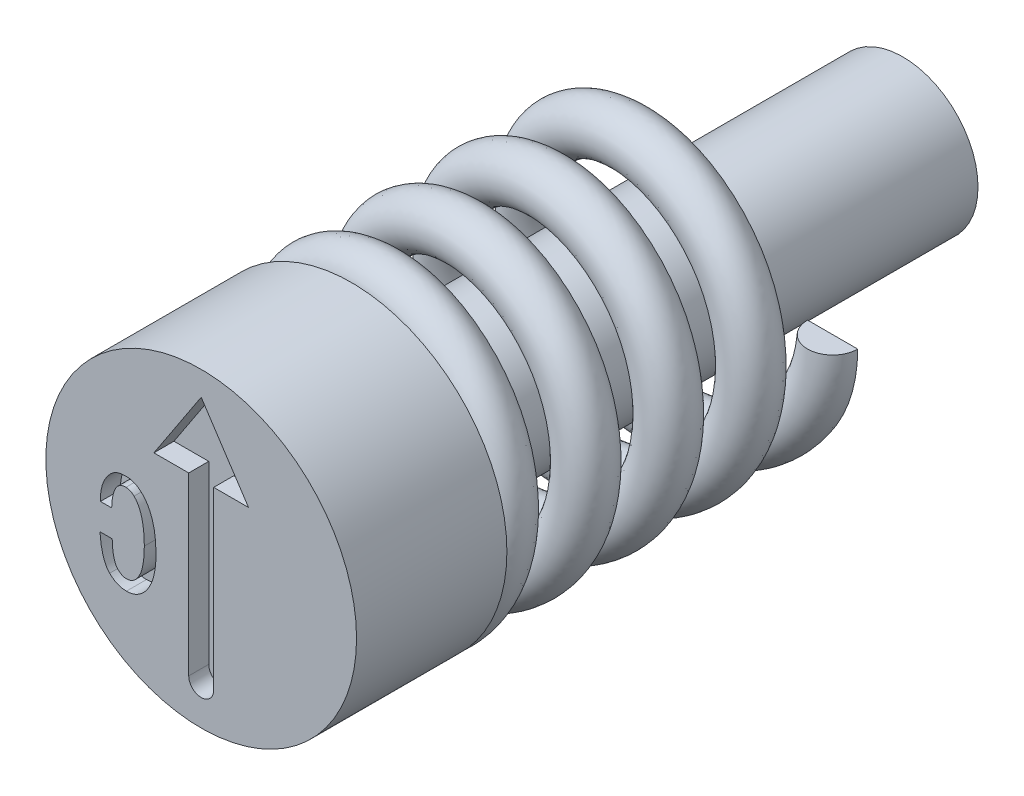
ISO-10303-21;
HEADER;
FILE_DESCRIPTION(('STEP AP214'),'2;1');
FILE_NAME('part.step','',(''),(''),'','','');
FILE_SCHEMA(('AUTOMOTIVE_DESIGN { 1 0 10303 214 1 1 1 1 }'));
ENDSEC;
DATA;
#1=APPLICATION_CONTEXT('core data for automotive mechanical design processes');
#2=APPLICATION_PROTOCOL_DEFINITION('international standard','automotive_design',2000,#1);
#3=PRODUCT_CONTEXT('',#1,'mechanical');
#4=PRODUCT('Part','Part','',(#3));
#5=PRODUCT_RELATED_PRODUCT_CATEGORY('part','',(#4));
#6=PRODUCT_DEFINITION_FORMATION('','',#4);
#7=PRODUCT_DEFINITION_CONTEXT('part definition',#1,'design');
#8=PRODUCT_DEFINITION('design','',#6,#7);
#9=PRODUCT_DEFINITION_SHAPE('','',#8);
#10=(LENGTH_UNIT() NAMED_UNIT(*) SI_UNIT(.MILLI.,.METRE.));
#11=(NAMED_UNIT(*) PLANE_ANGLE_UNIT() SI_UNIT($,.RADIAN.));
#12=(NAMED_UNIT(*) SI_UNIT($,.STERADIAN.) SOLID_ANGLE_UNIT());
#13=UNCERTAINTY_MEASURE_WITH_UNIT(LENGTH_MEASURE(1.E-05),#10,'distance_accuracy_value','');
#14=(GEOMETRIC_REPRESENTATION_CONTEXT(3) GLOBAL_UNCERTAINTY_ASSIGNED_CONTEXT((#13)) GLOBAL_UNIT_ASSIGNED_CONTEXT((#10,
#11,#12)) REPRESENTATION_CONTEXT('',''));
#15=CARTESIAN_POINT('',(0.,0.,0.));
#16=DIRECTION('',(0.,0.,1.));
#17=DIRECTION('',(1.,0.,0.));
#18=AXIS2_PLACEMENT_3D('',#15,#16,#17);
#19=CARTESIAN_POINT('',(2.6,0.,-10.5));
#20=DIRECTION('',(0.,-1.,0.));
#21=DIRECTION('',(0.,0.,-1.));
#22=AXIS2_PLACEMENT_3D('',#19,#20,#21);
#23=PLANE('',#22);
#24=CARTESIAN_POINT('',(2.6,0.,-10.));
#25=DIRECTION('',(0.,1.,0.));
#26=DIRECTION('',(0.,0.,1.));
#27=AXIS2_PLACEMENT_3D('',#24,#25,#26);
#28=CIRCLE('',#27,0.5);
#29=CARTESIAN_POINT('',(2.1,0.,-10.));
#30=VERTEX_POINT('',#29);
#31=CARTESIAN_POINT('',(3.1,0.,-10.));
#32=VERTEX_POINT('',#31);
#33=EDGE_CURVE('E88',#30,#32,#28,.T.);
#34=ORIENTED_EDGE('',*,*,#33,.T.);
#35=DIRECTION('',(-1.,0.,0.));
#36=VECTOR('',#35,1.);
#37=CARTESIAN_POINT('',(2.6,0.,-10.));
#38=LINE('',#37,#36);
#39=EDGE_CURVE('E75',#32,#30,#38,.T.);
#40=ORIENTED_EDGE('',*,*,#39,.T.);
#41=EDGE_LOOP('',(#34,#40));
#42=FACE_BOUND('',#41,.T.);
#43=ADVANCED_FACE('F49',(#42),#23,.F.);
#44=CARTESIAN_POINT('',(0.,-2.6,-3.5));
#45=DIRECTION('',(-1.,0.,0.));
#46=DIRECTION('',(0.,-1.,0.));
#47=AXIS2_PLACEMENT_3D('',#44,#45,#46);
#48=PLANE('',#47);
#49=DIRECTION('',(0.,-1.,0.));
#50=VECTOR('',#49,1.);
#51=CARTESIAN_POINT('',(0.,-2.6,-3.));
#52=LINE('',#51,#50);
#53=CARTESIAN_POINT('',(0.,-2.1,-3.));
#54=VERTEX_POINT('',#53);
#55=CARTESIAN_POINT('',(0.,-3.1,-3.));
#56=VERTEX_POINT('',#55);
#57=EDGE_CURVE('E69',#54,#56,#52,.T.);
#58=ORIENTED_EDGE('',*,*,#57,.F.);
#59=CARTESIAN_POINT('',(0.,-2.6,-3.));
#60=DIRECTION('',(-1.,0.,0.));
#61=DIRECTION('',(0.,-1.,0.));
#62=AXIS2_PLACEMENT_3D('',#59,#60,#61);
#63=CIRCLE('',#62,0.5);
#64=EDGE_CURVE('E85',#54,#56,#63,.T.);
#65=ORIENTED_EDGE('',*,*,#64,.T.);
#66=EDGE_LOOP('',(#58,#65));
#67=FACE_BOUND('',#66,.T.);
#68=ADVANCED_FACE('F51',(#67),#48,.T.);
#69=CARTESIAN_POINT('',(2.6,0.,-9.5));
#70=CARTESIAN_POINT('',(2.6,-1.07695526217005,-9.39705882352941));
#71=CARTESIAN_POINT('',(1.83847763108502,-1.83847763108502,-9.29411764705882));
#72=CARTESIAN_POINT('',(1.07695526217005,-2.6,-9.19117647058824));
#73=CARTESIAN_POINT('',(0.,-2.6,-9.08823529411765));
#74=CARTESIAN_POINT('',(-1.07695526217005,-2.6,-8.98529411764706));
#75=CARTESIAN_POINT('',(-1.83847763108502,-1.83847763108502,-8.88235294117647));
#76=CARTESIAN_POINT('',(-2.6,-1.07695526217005,-8.77941176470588));
#77=CARTESIAN_POINT('',(-2.6,0.,-8.6764705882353));
#78=CARTESIAN_POINT('',(-2.6,1.07695526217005,-8.57352941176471));
#79=CARTESIAN_POINT('',(-1.83847763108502,1.83847763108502,-8.47058823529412));
#80=CARTESIAN_POINT('',(-1.07695526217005,2.6,-8.36764705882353));
#81=CARTESIAN_POINT('',(0.,2.6,-8.26470588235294));
#82=CARTESIAN_POINT('',(1.07695526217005,2.6,-8.16176470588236));
#83=CARTESIAN_POINT('',(1.83847763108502,1.83847763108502,-8.05882352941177));
#84=CARTESIAN_POINT('',(2.6,1.07695526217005,-7.95588235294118));
#85=CARTESIAN_POINT('',(2.6,0.,-7.85294117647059));
#86=CARTESIAN_POINT('',(2.6,-1.07695526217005,-7.75));
#87=CARTESIAN_POINT('',(1.83847763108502,-1.83847763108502,-7.64705882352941));
#88=CARTESIAN_POINT('',(1.07695526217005,-2.6,-7.54411764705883));
#89=CARTESIAN_POINT('',(0.,-2.6,-7.44117647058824));
#90=CARTESIAN_POINT('',(-1.07695526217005,-2.6,-7.33823529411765));
#91=CARTESIAN_POINT('',(-1.83847763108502,-1.83847763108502,-7.23529411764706));
#92=CARTESIAN_POINT('',(-2.6,-1.07695526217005,-7.13235294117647));
#93=CARTESIAN_POINT('',(-2.6,0.,-7.02941176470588));
#94=CARTESIAN_POINT('',(-2.6,1.07695526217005,-6.9264705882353));
#95=CARTESIAN_POINT('',(-1.83847763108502,1.83847763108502,-6.82352941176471));
#96=CARTESIAN_POINT('',(-1.07695526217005,2.6,-6.72058823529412));
#97=CARTESIAN_POINT('',(0.,2.6,-6.61764705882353));
#98=CARTESIAN_POINT('',(1.07695526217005,2.6,-6.51470588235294));
#99=CARTESIAN_POINT('',(1.83847763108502,1.83847763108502,-6.41176470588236));
#100=CARTESIAN_POINT('',(2.6,1.07695526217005,-6.30882352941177));
#101=CARTESIAN_POINT('',(2.6,0.,-6.20588235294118));
#102=CARTESIAN_POINT('',(2.6,-1.07695526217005,-6.10294117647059));
#103=CARTESIAN_POINT('',(1.83847763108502,-1.83847763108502,-6.));
#104=CARTESIAN_POINT('',(1.07695526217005,-2.6,-5.89705882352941));
#105=CARTESIAN_POINT('',(0.,-2.6,-5.79411764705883));
#106=CARTESIAN_POINT('',(-1.07695526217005,-2.6,-5.69117647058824));
#107=CARTESIAN_POINT('',(-1.83847763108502,-1.83847763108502,-5.58823529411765));
#108=CARTESIAN_POINT('',(-2.6,-1.07695526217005,-5.48529411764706));
#109=CARTESIAN_POINT('',(-2.6,0.,-5.38235294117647));
#110=CARTESIAN_POINT('',(-2.6,1.07695526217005,-5.27941176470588));
#111=CARTESIAN_POINT('',(-1.83847763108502,1.83847763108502,-5.1764705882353));
#112=CARTESIAN_POINT('',(-1.07695526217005,2.6,-5.07352941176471));
#113=CARTESIAN_POINT('',(0.,2.6,-4.97058823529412));
#114=CARTESIAN_POINT('',(1.07695526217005,2.6,-4.86764705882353));
#115=CARTESIAN_POINT('',(1.83847763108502,1.83847763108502,-4.76470588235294));
#116=CARTESIAN_POINT('',(2.6,1.07695526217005,-4.66176470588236));
#117=CARTESIAN_POINT('',(2.6,0.,-4.55882352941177));
#118=CARTESIAN_POINT('',(2.6,-1.07695526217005,-4.45588235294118));
#119=CARTESIAN_POINT('',(1.83847763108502,-1.83847763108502,-4.35294117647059));
#120=CARTESIAN_POINT('',(1.07695526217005,-2.6,-4.25));
#121=CARTESIAN_POINT('',(0.,-2.6,-4.14705882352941));
#122=CARTESIAN_POINT('',(-1.07695526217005,-2.6,-4.04411764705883));
#123=CARTESIAN_POINT('',(-1.83847763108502,-1.83847763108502,-3.94117647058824));
#124=CARTESIAN_POINT('',(-2.6,-1.07695526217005,-3.83823529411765));
#125=CARTESIAN_POINT('',(-2.6,0.,-3.73529411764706));
#126=CARTESIAN_POINT('',(-2.6,1.07695526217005,-3.63235294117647));
#127=CARTESIAN_POINT('',(-1.83847763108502,1.83847763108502,-3.52941176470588));
#128=CARTESIAN_POINT('',(-1.07695526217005,2.6,-3.4264705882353));
#129=CARTESIAN_POINT('',(0.,2.6,-3.32352941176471));
#130=CARTESIAN_POINT('',(1.07695526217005,2.6,-3.22058823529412));
#131=CARTESIAN_POINT('',(1.83847763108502,1.83847763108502,-3.11764705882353));
#132=CARTESIAN_POINT('',(2.6,1.07695526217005,-3.01470588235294));
#133=CARTESIAN_POINT('',(2.6,0.,-2.91176470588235));
#134=CARTESIAN_POINT('',(2.6,-1.07695526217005,-2.80882352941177));
#135=CARTESIAN_POINT('',(1.83847763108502,-1.83847763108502,-2.70588235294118));
#136=CARTESIAN_POINT('',(1.07695526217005,-2.6,-2.60294117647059));
#137=CARTESIAN_POINT('',(0.,-2.6,-2.5));
#138=CARTESIAN_POINT('',(3.6,0.,-9.5));
#139=CARTESIAN_POINT('',(3.6,-1.49116882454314,-9.39705882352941));
#140=CARTESIAN_POINT('',(2.54558441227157,-2.54558441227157,-9.29411764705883));
#141=CARTESIAN_POINT('',(1.49116882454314,-3.6,-9.19117647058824));
#142=CARTESIAN_POINT('',(0.,-3.6,-9.08823529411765));
#143=CARTESIAN_POINT('',(-1.49116882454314,-3.6,-8.98529411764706));
#144=CARTESIAN_POINT('',(-2.54558441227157,-2.54558441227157,-8.88235294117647));
#145=CARTESIAN_POINT('',(-3.6,-1.49116882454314,-8.77941176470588));
#146=CARTESIAN_POINT('',(-3.6,0.,-8.6764705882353));
#147=CARTESIAN_POINT('',(-3.6,1.49116882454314,-8.57352941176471));
#148=CARTESIAN_POINT('',(-2.54558441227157,2.54558441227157,-8.47058823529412));
#149=CARTESIAN_POINT('',(-1.49116882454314,3.6,-8.36764705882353));
#150=CARTESIAN_POINT('',(0.,3.6,-8.26470588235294));
#151=CARTESIAN_POINT('',(1.49116882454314,3.6,-8.16176470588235));
#152=CARTESIAN_POINT('',(2.54558441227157,2.54558441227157,-8.05882352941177));
#153=CARTESIAN_POINT('',(3.6,1.49116882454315,-7.95588235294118));
#154=CARTESIAN_POINT('',(3.6,0.,-7.85294117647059));
#155=CARTESIAN_POINT('',(3.6,-1.49116882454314,-7.75));
#156=CARTESIAN_POINT('',(2.54558441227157,-2.54558441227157,-7.64705882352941));
#157=CARTESIAN_POINT('',(1.49116882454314,-3.6,-7.54411764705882));
#158=CARTESIAN_POINT('',(0.,-3.6,-7.44117647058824));
#159=CARTESIAN_POINT('',(-1.49116882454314,-3.6,-7.33823529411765));
#160=CARTESIAN_POINT('',(-2.54558441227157,-2.54558441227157,-7.23529411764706));
#161=CARTESIAN_POINT('',(-3.6,-1.49116882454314,-7.13235294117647));
#162=CARTESIAN_POINT('',(-3.6,0.,-7.02941176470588));
#163=CARTESIAN_POINT('',(-3.6,1.49116882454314,-6.92647058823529));
#164=CARTESIAN_POINT('',(-2.54558441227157,2.54558441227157,-6.82352941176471));
#165=CARTESIAN_POINT('',(-1.49116882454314,3.6,-6.72058823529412));
#166=CARTESIAN_POINT('',(0.,3.6,-6.61764705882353));
#167=CARTESIAN_POINT('',(1.49116882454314,3.6,-6.51470588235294));
#168=CARTESIAN_POINT('',(2.54558441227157,2.54558441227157,-6.41176470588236));
#169=CARTESIAN_POINT('',(3.6,1.49116882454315,-6.30882352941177));
#170=CARTESIAN_POINT('',(3.6,0.,-6.20588235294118));
#171=CARTESIAN_POINT('',(3.6,-1.49116882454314,-6.10294117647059));
#172=CARTESIAN_POINT('',(2.54558441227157,-2.54558441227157,-6.));
#173=CARTESIAN_POINT('',(1.49116882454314,-3.6,-5.89705882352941));
#174=CARTESIAN_POINT('',(0.,-3.6,-5.79411764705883));
#175=CARTESIAN_POINT('',(-1.49116882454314,-3.6,-5.69117647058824));
#176=CARTESIAN_POINT('',(-2.54558441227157,-2.54558441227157,-5.58823529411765));
#177=CARTESIAN_POINT('',(-3.6,-1.49116882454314,-5.48529411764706));
#178=CARTESIAN_POINT('',(-3.6,0.,-5.38235294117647));
#179=CARTESIAN_POINT('',(-3.6,1.49116882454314,-5.27941176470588));
#180=CARTESIAN_POINT('',(-2.54558441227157,2.54558441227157,-5.1764705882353));
#181=CARTESIAN_POINT('',(-1.49116882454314,3.6,-5.07352941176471));
#182=CARTESIAN_POINT('',(0.,3.6,-4.97058823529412));
#183=CARTESIAN_POINT('',(1.49116882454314,3.6,-4.86764705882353));
#184=CARTESIAN_POINT('',(2.54558441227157,2.54558441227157,-4.76470588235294));
#185=CARTESIAN_POINT('',(3.6,1.49116882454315,-4.66176470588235));
#186=CARTESIAN_POINT('',(3.6,0.,-4.55882352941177));
#187=CARTESIAN_POINT('',(3.6,-1.49116882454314,-4.45588235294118));
#188=CARTESIAN_POINT('',(2.54558441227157,-2.54558441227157,-4.35294117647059));
#189=CARTESIAN_POINT('',(1.49116882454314,-3.6,-4.25));
#190=CARTESIAN_POINT('',(0.,-3.6,-4.14705882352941));
#191=CARTESIAN_POINT('',(-1.49116882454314,-3.6,-4.04411764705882));
#192=CARTESIAN_POINT('',(-2.54558441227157,-2.54558441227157,-3.94117647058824));
#193=CARTESIAN_POINT('',(-3.6,-1.49116882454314,-3.83823529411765));
#194=CARTESIAN_POINT('',(-3.6,0.,-3.73529411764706));
#195=CARTESIAN_POINT('',(-3.6,1.49116882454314,-3.63235294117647));
#196=CARTESIAN_POINT('',(-2.54558441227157,2.54558441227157,-3.52941176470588));
#197=CARTESIAN_POINT('',(-1.49116882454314,3.6,-3.42647058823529));
#198=CARTESIAN_POINT('',(0.,3.6,-3.32352941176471));
#199=CARTESIAN_POINT('',(1.49116882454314,3.6,-3.22058823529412));
#200=CARTESIAN_POINT('',(2.54558441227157,2.54558441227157,-3.11764705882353));
#201=CARTESIAN_POINT('',(3.6,1.49116882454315,-3.01470588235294));
#202=CARTESIAN_POINT('',(3.6,0.,-2.91176470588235));
#203=CARTESIAN_POINT('',(3.6,-1.49116882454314,-2.80882352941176));
#204=CARTESIAN_POINT('',(2.54558441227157,-2.54558441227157,-2.70588235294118));
#205=CARTESIAN_POINT('',(1.49116882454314,-3.6,-2.60294117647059));
#206=CARTESIAN_POINT('',(0.,-3.6,-2.5));
#207=CARTESIAN_POINT('',(3.6,0.,-10.5));
#208=CARTESIAN_POINT('',(3.6,-1.49116882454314,-10.3970588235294));
#209=CARTESIAN_POINT('',(2.54558441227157,-2.54558441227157,-10.2941176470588));
#210=CARTESIAN_POINT('',(1.49116882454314,-3.6,-10.1911764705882));
#211=CARTESIAN_POINT('',(0.,-3.6,-10.0882352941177));
#212=CARTESIAN_POINT('',(-1.49116882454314,-3.6,-9.98529411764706));
#213=CARTESIAN_POINT('',(-2.54558441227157,-2.54558441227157,-9.88235294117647));
#214=CARTESIAN_POINT('',(-3.6,-1.49116882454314,-9.77941176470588));
#215=CARTESIAN_POINT('',(-3.6,0.,-9.6764705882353));
#216=CARTESIAN_POINT('',(-3.6,1.49116882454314,-9.57352941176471));
#217=CARTESIAN_POINT('',(-2.54558441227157,2.54558441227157,-9.47058823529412));
#218=CARTESIAN_POINT('',(-1.49116882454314,3.6,-9.36764705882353));
#219=CARTESIAN_POINT('',(0.,3.6,-9.26470588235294));
#220=CARTESIAN_POINT('',(1.49116882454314,3.6,-9.16176470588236));
#221=CARTESIAN_POINT('',(2.54558441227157,2.54558441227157,-9.05882352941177));
#222=CARTESIAN_POINT('',(3.6,1.49116882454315,-8.95588235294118));
#223=CARTESIAN_POINT('',(3.6,0.,-8.85294117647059));
#224=CARTESIAN_POINT('',(3.6,-1.49116882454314,-8.75));
#225=CARTESIAN_POINT('',(2.54558441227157,-2.54558441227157,-8.64705882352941));
#226=CARTESIAN_POINT('',(1.49116882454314,-3.6,-8.54411764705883));
#227=CARTESIAN_POINT('',(0.,-3.6,-8.44117647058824));
#228=CARTESIAN_POINT('',(-1.49116882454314,-3.6,-8.33823529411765));
#229=CARTESIAN_POINT('',(-2.54558441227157,-2.54558441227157,-8.23529411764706));
#230=CARTESIAN_POINT('',(-3.6,-1.49116882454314,-8.13235294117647));
#231=CARTESIAN_POINT('',(-3.6,0.,-8.02941176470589));
#232=CARTESIAN_POINT('',(-3.6,1.49116882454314,-7.9264705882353));
#233=CARTESIAN_POINT('',(-2.54558441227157,2.54558441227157,-7.82352941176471));
#234=CARTESIAN_POINT('',(-1.49116882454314,3.6,-7.72058823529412));
#235=CARTESIAN_POINT('',(0.,3.6,-7.61764705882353));
#236=CARTESIAN_POINT('',(1.49116882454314,3.6,-7.51470588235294));
#237=CARTESIAN_POINT('',(2.54558441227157,2.54558441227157,-7.41176470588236));
#238=CARTESIAN_POINT('',(3.6,1.49116882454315,-7.30882352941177));
#239=CARTESIAN_POINT('',(3.6,0.,-7.20588235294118));
#240=CARTESIAN_POINT('',(3.6,-1.49116882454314,-7.10294117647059));
#241=CARTESIAN_POINT('',(2.54558441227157,-2.54558441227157,-7.));
#242=CARTESIAN_POINT('',(1.49116882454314,-3.6,-6.89705882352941));
#243=CARTESIAN_POINT('',(0.,-3.6,-6.79411764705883));
#244=CARTESIAN_POINT('',(-1.49116882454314,-3.6,-6.69117647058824));
#245=CARTESIAN_POINT('',(-2.54558441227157,-2.54558441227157,-6.58823529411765));
#246=CARTESIAN_POINT('',(-3.6,-1.49116882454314,-6.48529411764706));
#247=CARTESIAN_POINT('',(-3.6,0.,-6.38235294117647));
#248=CARTESIAN_POINT('',(-3.6,1.49116882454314,-6.27941176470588));
#249=CARTESIAN_POINT('',(-2.54558441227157,2.54558441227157,-6.1764705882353));
#250=CARTESIAN_POINT('',(-1.49116882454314,3.6,-6.07352941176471));
#251=CARTESIAN_POINT('',(0.,3.6,-5.97058823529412));
#252=CARTESIAN_POINT('',(1.49116882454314,3.6,-5.86764705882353));
#253=CARTESIAN_POINT('',(2.54558441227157,2.54558441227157,-5.76470588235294));
#254=CARTESIAN_POINT('',(3.6,1.49116882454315,-5.66176470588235));
#255=CARTESIAN_POINT('',(3.6,0.,-5.55882352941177));
#256=CARTESIAN_POINT('',(3.6,-1.49116882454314,-5.45588235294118));
#257=CARTESIAN_POINT('',(2.54558441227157,-2.54558441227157,-5.35294117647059));
#258=CARTESIAN_POINT('',(1.49116882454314,-3.6,-5.25));
#259=CARTESIAN_POINT('',(0.,-3.6,-5.14705882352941));
#260=CARTESIAN_POINT('',(-1.49116882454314,-3.6,-5.04411764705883));
#261=CARTESIAN_POINT('',(-2.54558441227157,-2.54558441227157,-4.94117647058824));
#262=CARTESIAN_POINT('',(-3.6,-1.49116882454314,-4.83823529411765));
#263=CARTESIAN_POINT('',(-3.6,0.,-4.73529411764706));
#264=CARTESIAN_POINT('',(-3.6,1.49116882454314,-4.63235294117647));
#265=CARTESIAN_POINT('',(-2.54558441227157,2.54558441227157,-4.52941176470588));
#266=CARTESIAN_POINT('',(-1.49116882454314,3.6,-4.4264705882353));
#267=CARTESIAN_POINT('',(0.,3.6,-4.32352941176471));
#268=CARTESIAN_POINT('',(1.49116882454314,3.6,-4.22058823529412));
#269=CARTESIAN_POINT('',(2.54558441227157,2.54558441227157,-4.11764705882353));
#270=CARTESIAN_POINT('',(3.6,1.49116882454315,-4.01470588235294));
#271=CARTESIAN_POINT('',(3.6,0.,-3.91176470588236));
#272=CARTESIAN_POINT('',(3.6,-1.49116882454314,-3.80882352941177));
#273=CARTESIAN_POINT('',(2.54558441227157,-2.54558441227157,-3.70588235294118));
#274=CARTESIAN_POINT('',(1.49116882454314,-3.6,-3.60294117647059));
#275=CARTESIAN_POINT('',(0.,-3.6,-3.5));
#276=CARTESIAN_POINT('',(2.6,0.,-10.5));
#277=CARTESIAN_POINT('',(2.6,-1.07695526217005,-10.3970588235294));
#278=CARTESIAN_POINT('',(1.83847763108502,-1.83847763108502,-10.2941176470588));
#279=CARTESIAN_POINT('',(1.07695526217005,-2.6,-10.1911764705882));
#280=CARTESIAN_POINT('',(0.,-2.6,-10.0882352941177));
#281=CARTESIAN_POINT('',(-1.07695526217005,-2.6,-9.98529411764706));
#282=CARTESIAN_POINT('',(-1.83847763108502,-1.83847763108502,-9.88235294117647));
#283=CARTESIAN_POINT('',(-2.6,-1.07695526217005,-9.77941176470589));
#284=CARTESIAN_POINT('',(-2.6,0.,-9.6764705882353));
#285=CARTESIAN_POINT('',(-2.6,1.07695526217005,-9.57352941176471));
#286=CARTESIAN_POINT('',(-1.83847763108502,1.83847763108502,-9.47058823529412));
#287=CARTESIAN_POINT('',(-1.07695526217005,2.6,-9.36764705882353));
#288=CARTESIAN_POINT('',(0.,2.6,-9.26470588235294));
#289=CARTESIAN_POINT('',(1.07695526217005,2.6,-9.16176470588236));
#290=CARTESIAN_POINT('',(1.83847763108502,1.83847763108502,-9.05882352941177));
#291=CARTESIAN_POINT('',(2.6,1.07695526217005,-8.95588235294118));
#292=CARTESIAN_POINT('',(2.6,0.,-8.85294117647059));
#293=CARTESIAN_POINT('',(2.6,-1.07695526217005,-8.75));
#294=CARTESIAN_POINT('',(1.83847763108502,-1.83847763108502,-8.64705882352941));
#295=CARTESIAN_POINT('',(1.07695526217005,-2.6,-8.54411764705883));
#296=CARTESIAN_POINT('',(0.,-2.6,-8.44117647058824));
#297=CARTESIAN_POINT('',(-1.07695526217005,-2.6,-8.33823529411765));
#298=CARTESIAN_POINT('',(-1.83847763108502,-1.83847763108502,-8.23529411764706));
#299=CARTESIAN_POINT('',(-2.6,-1.07695526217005,-8.13235294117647));
#300=CARTESIAN_POINT('',(-2.6,0.,-8.02941176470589));
#301=CARTESIAN_POINT('',(-2.6,1.07695526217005,-7.9264705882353));
#302=CARTESIAN_POINT('',(-1.83847763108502,1.83847763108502,-7.82352941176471));
#303=CARTESIAN_POINT('',(-1.07695526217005,2.6,-7.72058823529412));
#304=CARTESIAN_POINT('',(0.,2.6,-7.61764705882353));
#305=CARTESIAN_POINT('',(1.07695526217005,2.6,-7.51470588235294));
#306=CARTESIAN_POINT('',(1.83847763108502,1.83847763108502,-7.41176470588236));
#307=CARTESIAN_POINT('',(2.6,1.07695526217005,-7.30882352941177));
#308=CARTESIAN_POINT('',(2.6,0.,-7.20588235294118));
#309=CARTESIAN_POINT('',(2.6,-1.07695526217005,-7.10294117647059));
#310=CARTESIAN_POINT('',(1.83847763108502,-1.83847763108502,-7.));
#311=CARTESIAN_POINT('',(1.07695526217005,-2.6,-6.89705882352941));
#312=CARTESIAN_POINT('',(0.,-2.6,-6.79411764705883));
#313=CARTESIAN_POINT('',(-1.07695526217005,-2.6,-6.69117647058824));
#314=CARTESIAN_POINT('',(-1.83847763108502,-1.83847763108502,-6.58823529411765));
#315=CARTESIAN_POINT('',(-2.6,-1.07695526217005,-6.48529411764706));
#316=CARTESIAN_POINT('',(-2.6,0.,-6.38235294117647));
#317=CARTESIAN_POINT('',(-2.6,1.07695526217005,-6.27941176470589));
#318=CARTESIAN_POINT('',(-1.83847763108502,1.83847763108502,-6.1764705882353));
#319=CARTESIAN_POINT('',(-1.07695526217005,2.6,-6.07352941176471));
#320=CARTESIAN_POINT('',(0.,2.6,-5.97058823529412));
#321=CARTESIAN_POINT('',(1.07695526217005,2.6,-5.86764705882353));
#322=CARTESIAN_POINT('',(1.83847763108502,1.83847763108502,-5.76470588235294));
#323=CARTESIAN_POINT('',(2.6,1.07695526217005,-5.66176470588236));
#324=CARTESIAN_POINT('',(2.6,0.,-5.55882352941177));
#325=CARTESIAN_POINT('',(2.6,-1.07695526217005,-5.45588235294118));
#326=CARTESIAN_POINT('',(1.83847763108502,-1.83847763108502,-5.35294117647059));
#327=CARTESIAN_POINT('',(1.07695526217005,-2.6,-5.25));
#328=CARTESIAN_POINT('',(0.,-2.6,-5.14705882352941));
#329=CARTESIAN_POINT('',(-1.07695526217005,-2.6,-5.04411764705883));
#330=CARTESIAN_POINT('',(-1.83847763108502,-1.83847763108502,-4.94117647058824));
#331=CARTESIAN_POINT('',(-2.6,-1.07695526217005,-4.83823529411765));
#332=CARTESIAN_POINT('',(-2.6,0.,-4.73529411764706));
#333=CARTESIAN_POINT('',(-2.6,1.07695526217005,-4.63235294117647));
#334=CARTESIAN_POINT('',(-1.83847763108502,1.83847763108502,-4.52941176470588));
#335=CARTESIAN_POINT('',(-1.07695526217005,2.6,-4.4264705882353));
#336=CARTESIAN_POINT('',(0.,2.6,-4.32352941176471));
#337=CARTESIAN_POINT('',(1.07695526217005,2.6,-4.22058823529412));
#338=CARTESIAN_POINT('',(1.83847763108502,1.83847763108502,-4.11764705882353));
#339=CARTESIAN_POINT('',(2.6,1.07695526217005,-4.01470588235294));
#340=CARTESIAN_POINT('',(2.6,0.,-3.91176470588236));
#341=CARTESIAN_POINT('',(2.6,-1.07695526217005,-3.80882352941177));
#342=CARTESIAN_POINT('',(1.83847763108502,-1.83847763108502,-3.70588235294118));
#343=CARTESIAN_POINT('',(1.07695526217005,-2.6,-3.60294117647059));
#344=CARTESIAN_POINT('',(0.,-2.6,-3.5));
#345=CARTESIAN_POINT('',(1.6,0.,-10.5));
#346=CARTESIAN_POINT('',(1.6,-0.662741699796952,-10.3970588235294));
#347=CARTESIAN_POINT('',(1.13137084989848,-1.13137084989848,-10.2941176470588));
#348=CARTESIAN_POINT('',(0.662741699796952,-1.6,-10.1911764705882));
#349=CARTESIAN_POINT('',(0.,-1.6,-10.0882352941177));
#350=CARTESIAN_POINT('',(-0.662741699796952,-1.6,-9.98529411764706));
#351=CARTESIAN_POINT('',(-1.13137084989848,-1.13137084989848,-9.88235294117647));
#352=CARTESIAN_POINT('',(-1.6,-0.662741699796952,-9.77941176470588));
#353=CARTESIAN_POINT('',(-1.6,0.,-9.6764705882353));
#354=CARTESIAN_POINT('',(-1.6,0.662741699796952,-9.57352941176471));
#355=CARTESIAN_POINT('',(-1.13137084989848,1.13137084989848,-9.47058823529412));
#356=CARTESIAN_POINT('',(-0.662741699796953,1.6,-9.36764705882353));
#357=CARTESIAN_POINT('',(0.,1.6,-9.26470588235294));
#358=CARTESIAN_POINT('',(0.662741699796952,1.6,-9.16176470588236));
#359=CARTESIAN_POINT('',(1.13137084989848,1.13137084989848,-9.05882352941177));
#360=CARTESIAN_POINT('',(1.6,0.662741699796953,-8.95588235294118));
#361=CARTESIAN_POINT('',(1.6,0.,-8.85294117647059));
#362=CARTESIAN_POINT('',(1.6,-0.662741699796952,-8.75));
#363=CARTESIAN_POINT('',(1.13137084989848,-1.13137084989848,-8.64705882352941));
#364=CARTESIAN_POINT('',(0.662741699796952,-1.6,-8.54411764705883));
#365=CARTESIAN_POINT('',(0.,-1.6,-8.44117647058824));
#366=CARTESIAN_POINT('',(-0.662741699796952,-1.6,-8.33823529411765));
#367=CARTESIAN_POINT('',(-1.13137084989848,-1.13137084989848,-8.23529411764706));
#368=CARTESIAN_POINT('',(-1.6,-0.662741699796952,-8.13235294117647));
#369=CARTESIAN_POINT('',(-1.6,0.,-8.02941176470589));
#370=CARTESIAN_POINT('',(-1.6,0.662741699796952,-7.9264705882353));
#371=CARTESIAN_POINT('',(-1.13137084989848,1.13137084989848,-7.82352941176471));
#372=CARTESIAN_POINT('',(-0.662741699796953,1.6,-7.72058823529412));
#373=CARTESIAN_POINT('',(0.,1.6,-7.61764705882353));
#374=CARTESIAN_POINT('',(0.662741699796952,1.6,-7.51470588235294));
#375=CARTESIAN_POINT('',(1.13137084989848,1.13137084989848,-7.41176470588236));
#376=CARTESIAN_POINT('',(1.6,0.662741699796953,-7.30882352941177));
#377=CARTESIAN_POINT('',(1.6,0.,-7.20588235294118));
#378=CARTESIAN_POINT('',(1.6,-0.662741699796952,-7.10294117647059));
#379=CARTESIAN_POINT('',(1.13137084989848,-1.13137084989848,-7.));
#380=CARTESIAN_POINT('',(0.662741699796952,-1.6,-6.89705882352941));
#381=CARTESIAN_POINT('',(0.,-1.6,-6.79411764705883));
#382=CARTESIAN_POINT('',(-0.662741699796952,-1.6,-6.69117647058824));
#383=CARTESIAN_POINT('',(-1.13137084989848,-1.13137084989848,-6.58823529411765));
#384=CARTESIAN_POINT('',(-1.6,-0.662741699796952,-6.48529411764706));
#385=CARTESIAN_POINT('',(-1.6,0.,-6.38235294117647));
#386=CARTESIAN_POINT('',(-1.6,0.662741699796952,-6.27941176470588));
#387=CARTESIAN_POINT('',(-1.13137084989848,1.13137084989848,-6.1764705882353));
#388=CARTESIAN_POINT('',(-0.662741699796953,1.6,-6.07352941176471));
#389=CARTESIAN_POINT('',(0.,1.6,-5.97058823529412));
#390=CARTESIAN_POINT('',(0.662741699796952,1.6,-5.86764705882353));
#391=CARTESIAN_POINT('',(1.13137084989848,1.13137084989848,-5.76470588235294));
#392=CARTESIAN_POINT('',(1.6,0.662741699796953,-5.66176470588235));
#393=CARTESIAN_POINT('',(1.6,0.,-5.55882352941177));
#394=CARTESIAN_POINT('',(1.6,-0.662741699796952,-5.45588235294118));
#395=CARTESIAN_POINT('',(1.13137084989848,-1.13137084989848,-5.35294117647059));
#396=CARTESIAN_POINT('',(0.662741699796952,-1.6,-5.25));
#397=CARTESIAN_POINT('',(0.,-1.6,-5.14705882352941));
#398=CARTESIAN_POINT('',(-0.662741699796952,-1.6,-5.04411764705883));
#399=CARTESIAN_POINT('',(-1.13137084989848,-1.13137084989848,-4.94117647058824));
#400=CARTESIAN_POINT('',(-1.6,-0.662741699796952,-4.83823529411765));
#401=CARTESIAN_POINT('',(-1.6,0.,-4.73529411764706));
#402=CARTESIAN_POINT('',(-1.6,0.662741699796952,-4.63235294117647));
#403=CARTESIAN_POINT('',(-1.13137084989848,1.13137084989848,-4.52941176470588));
#404=CARTESIAN_POINT('',(-0.662741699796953,1.6,-4.4264705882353));
#405=CARTESIAN_POINT('',(0.,1.6,-4.32352941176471));
#406=CARTESIAN_POINT('',(0.662741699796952,1.6,-4.22058823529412));
#407=CARTESIAN_POINT('',(1.13137084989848,1.13137084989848,-4.11764705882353));
#408=CARTESIAN_POINT('',(1.6,0.662741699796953,-4.01470588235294));
#409=CARTESIAN_POINT('',(1.6,0.,-3.91176470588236));
#410=CARTESIAN_POINT('',(1.6,-0.662741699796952,-3.80882352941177));
#411=CARTESIAN_POINT('',(1.13137084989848,-1.13137084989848,-3.70588235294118));
#412=CARTESIAN_POINT('',(0.662741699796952,-1.6,-3.60294117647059));
#413=CARTESIAN_POINT('',(0.,-1.6,-3.5));
#414=CARTESIAN_POINT('',(1.6,0.,-9.5));
#415=CARTESIAN_POINT('',(1.6,-0.662741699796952,-9.39705882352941));
#416=CARTESIAN_POINT('',(1.13137084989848,-1.13137084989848,-9.29411764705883));
#417=CARTESIAN_POINT('',(0.662741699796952,-1.6,-9.19117647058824));
#418=CARTESIAN_POINT('',(0.,-1.6,-9.08823529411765));
#419=CARTESIAN_POINT('',(-0.662741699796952,-1.6,-8.98529411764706));
#420=CARTESIAN_POINT('',(-1.13137084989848,-1.13137084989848,-8.88235294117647));
#421=CARTESIAN_POINT('',(-1.6,-0.662741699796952,-8.77941176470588));
#422=CARTESIAN_POINT('',(-1.6,0.,-8.6764705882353));
#423=CARTESIAN_POINT('',(-1.6,0.662741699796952,-8.57352941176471));
#424=CARTESIAN_POINT('',(-1.13137084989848,1.13137084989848,-8.47058823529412));
#425=CARTESIAN_POINT('',(-0.662741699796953,1.6,-8.36764705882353));
#426=CARTESIAN_POINT('',(0.,1.6,-8.26470588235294));
#427=CARTESIAN_POINT('',(0.662741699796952,1.6,-8.16176470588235));
#428=CARTESIAN_POINT('',(1.13137084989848,1.13137084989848,-8.05882352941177));
#429=CARTESIAN_POINT('',(1.6,0.662741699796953,-7.95588235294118));
#430=CARTESIAN_POINT('',(1.6,0.,-7.85294117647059));
#431=CARTESIAN_POINT('',(1.6,-0.662741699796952,-7.75));
#432=CARTESIAN_POINT('',(1.13137084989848,-1.13137084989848,-7.64705882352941));
#433=CARTESIAN_POINT('',(0.662741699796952,-1.6,-7.54411764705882));
#434=CARTESIAN_POINT('',(0.,-1.6,-7.44117647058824));
#435=CARTESIAN_POINT('',(-0.662741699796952,-1.6,-7.33823529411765));
#436=CARTESIAN_POINT('',(-1.13137084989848,-1.13137084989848,-7.23529411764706));
#437=CARTESIAN_POINT('',(-1.6,-0.662741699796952,-7.13235294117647));
#438=CARTESIAN_POINT('',(-1.6,0.,-7.02941176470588));
#439=CARTESIAN_POINT('',(-1.6,0.662741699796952,-6.92647058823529));
#440=CARTESIAN_POINT('',(-1.13137084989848,1.13137084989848,-6.82352941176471));
#441=CARTESIAN_POINT('',(-0.662741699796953,1.6,-6.72058823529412));
#442=CARTESIAN_POINT('',(0.,1.6,-6.61764705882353));
#443=CARTESIAN_POINT('',(0.662741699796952,1.6,-6.51470588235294));
#444=CARTESIAN_POINT('',(1.13137084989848,1.13137084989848,-6.41176470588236));
#445=CARTESIAN_POINT('',(1.6,0.662741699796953,-6.30882352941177));
#446=CARTESIAN_POINT('',(1.6,0.,-6.20588235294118));
#447=CARTESIAN_POINT('',(1.6,-0.662741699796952,-6.10294117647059));
#448=CARTESIAN_POINT('',(1.13137084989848,-1.13137084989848,-6.));
#449=CARTESIAN_POINT('',(0.662741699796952,-1.6,-5.89705882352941));
#450=CARTESIAN_POINT('',(0.,-1.6,-5.79411764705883));
#451=CARTESIAN_POINT('',(-0.662741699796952,-1.6,-5.69117647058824));
#452=CARTESIAN_POINT('',(-1.13137084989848,-1.13137084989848,-5.58823529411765));
#453=CARTESIAN_POINT('',(-1.6,-0.662741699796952,-5.48529411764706));
#454=CARTESIAN_POINT('',(-1.6,0.,-5.38235294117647));
#455=CARTESIAN_POINT('',(-1.6,0.662741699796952,-5.27941176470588));
#456=CARTESIAN_POINT('',(-1.13137084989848,1.13137084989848,-5.1764705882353));
#457=CARTESIAN_POINT('',(-0.662741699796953,1.6,-5.07352941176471));
#458=CARTESIAN_POINT('',(0.,1.6,-4.97058823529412));
#459=CARTESIAN_POINT('',(0.662741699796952,1.6,-4.86764705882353));
#460=CARTESIAN_POINT('',(1.13137084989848,1.13137084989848,-4.76470588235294));
#461=CARTESIAN_POINT('',(1.6,0.662741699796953,-4.66176470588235));
#462=CARTESIAN_POINT('',(1.6,0.,-4.55882352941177));
#463=CARTESIAN_POINT('',(1.6,-0.662741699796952,-4.45588235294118));
#464=CARTESIAN_POINT('',(1.13137084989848,-1.13137084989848,-4.35294117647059));
#465=CARTESIAN_POINT('',(0.662741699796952,-1.6,-4.25));
#466=CARTESIAN_POINT('',(0.,-1.6,-4.14705882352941));
#467=CARTESIAN_POINT('',(-0.662741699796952,-1.6,-4.04411764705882));
#468=CARTESIAN_POINT('',(-1.13137084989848,-1.13137084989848,-3.94117647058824));
#469=CARTESIAN_POINT('',(-1.6,-0.662741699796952,-3.83823529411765));
#470=CARTESIAN_POINT('',(-1.6,0.,-3.73529411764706));
#471=CARTESIAN_POINT('',(-1.6,0.662741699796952,-3.63235294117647));
#472=CARTESIAN_POINT('',(-1.13137084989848,1.13137084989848,-3.52941176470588));
#473=CARTESIAN_POINT('',(-0.662741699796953,1.6,-3.42647058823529));
#474=CARTESIAN_POINT('',(0.,1.6,-3.32352941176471));
#475=CARTESIAN_POINT('',(0.662741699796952,1.6,-3.22058823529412));
#476=CARTESIAN_POINT('',(1.13137084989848,1.13137084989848,-3.11764705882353));
#477=CARTESIAN_POINT('',(1.6,0.662741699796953,-3.01470588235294));
#478=CARTESIAN_POINT('',(1.6,0.,-2.91176470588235));
#479=CARTESIAN_POINT('',(1.6,-0.662741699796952,-2.80882352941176));
#480=CARTESIAN_POINT('',(1.13137084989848,-1.13137084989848,-2.70588235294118));
#481=CARTESIAN_POINT('',(0.662741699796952,-1.6,-2.60294117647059));
#482=CARTESIAN_POINT('',(0.,-1.6,-2.5));
#483=CARTESIAN_POINT('',(2.6,0.,-9.5));
#484=CARTESIAN_POINT('',(2.6,-1.07695526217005,-9.39705882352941));
#485=CARTESIAN_POINT('',(1.83847763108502,-1.83847763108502,-9.29411764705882));
#486=CARTESIAN_POINT('',(1.07695526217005,-2.6,-9.19117647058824));
#487=CARTESIAN_POINT('',(0.,-2.6,-9.08823529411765));
#488=CARTESIAN_POINT('',(-1.07695526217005,-2.6,-8.98529411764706));
#489=CARTESIAN_POINT('',(-1.83847763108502,-1.83847763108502,-8.88235294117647));
#490=CARTESIAN_POINT('',(-2.6,-1.07695526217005,-8.77941176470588));
#491=CARTESIAN_POINT('',(-2.6,0.,-8.6764705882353));
#492=CARTESIAN_POINT('',(-2.6,1.07695526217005,-8.57352941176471));
#493=CARTESIAN_POINT('',(-1.83847763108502,1.83847763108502,-8.47058823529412));
#494=CARTESIAN_POINT('',(-1.07695526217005,2.6,-8.36764705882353));
#495=CARTESIAN_POINT('',(0.,2.6,-8.26470588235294));
#496=CARTESIAN_POINT('',(1.07695526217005,2.6,-8.16176470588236));
#497=CARTESIAN_POINT('',(1.83847763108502,1.83847763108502,-8.05882352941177));
#498=CARTESIAN_POINT('',(2.6,1.07695526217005,-7.95588235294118));
#499=CARTESIAN_POINT('',(2.6,0.,-7.85294117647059));
#500=CARTESIAN_POINT('',(2.6,-1.07695526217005,-7.75));
#501=CARTESIAN_POINT('',(1.83847763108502,-1.83847763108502,-7.64705882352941));
#502=CARTESIAN_POINT('',(1.07695526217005,-2.6,-7.54411764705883));
#503=CARTESIAN_POINT('',(0.,-2.6,-7.44117647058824));
#504=CARTESIAN_POINT('',(-1.07695526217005,-2.6,-7.33823529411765));
#505=CARTESIAN_POINT('',(-1.83847763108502,-1.83847763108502,-7.23529411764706));
#506=CARTESIAN_POINT('',(-2.6,-1.07695526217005,-7.13235294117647));
#507=CARTESIAN_POINT('',(-2.6,0.,-7.02941176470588));
#508=CARTESIAN_POINT('',(-2.6,1.07695526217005,-6.9264705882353));
#509=CARTESIAN_POINT('',(-1.83847763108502,1.83847763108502,-6.82352941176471));
#510=CARTESIAN_POINT('',(-1.07695526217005,2.6,-6.72058823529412));
#511=CARTESIAN_POINT('',(0.,2.6,-6.61764705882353));
#512=CARTESIAN_POINT('',(1.07695526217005,2.6,-6.51470588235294));
#513=CARTESIAN_POINT('',(1.83847763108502,1.83847763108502,-6.41176470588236));
#514=CARTESIAN_POINT('',(2.6,1.07695526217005,-6.30882352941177));
#515=CARTESIAN_POINT('',(2.6,0.,-6.20588235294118));
#516=CARTESIAN_POINT('',(2.6,-1.07695526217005,-6.10294117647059));
#517=CARTESIAN_POINT('',(1.83847763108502,-1.83847763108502,-6.));
#518=CARTESIAN_POINT('',(1.07695526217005,-2.6,-5.89705882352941));
#519=CARTESIAN_POINT('',(0.,-2.6,-5.79411764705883));
#520=CARTESIAN_POINT('',(-1.07695526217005,-2.6,-5.69117647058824));
#521=CARTESIAN_POINT('',(-1.83847763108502,-1.83847763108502,-5.58823529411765));
#522=CARTESIAN_POINT('',(-2.6,-1.07695526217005,-5.48529411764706));
#523=CARTESIAN_POINT('',(-2.6,0.,-5.38235294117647));
#524=CARTESIAN_POINT('',(-2.6,1.07695526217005,-5.27941176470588));
#525=CARTESIAN_POINT('',(-1.83847763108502,1.83847763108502,-5.1764705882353));
#526=CARTESIAN_POINT('',(-1.07695526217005,2.6,-5.07352941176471));
#527=CARTESIAN_POINT('',(0.,2.6,-4.97058823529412));
#528=CARTESIAN_POINT('',(1.07695526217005,2.6,-4.86764705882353));
#529=CARTESIAN_POINT('',(1.83847763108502,1.83847763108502,-4.76470588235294));
#530=CARTESIAN_POINT('',(2.6,1.07695526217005,-4.66176470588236));
#531=CARTESIAN_POINT('',(2.6,0.,-4.55882352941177));
#532=CARTESIAN_POINT('',(2.6,-1.07695526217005,-4.45588235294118));
#533=CARTESIAN_POINT('',(1.83847763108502,-1.83847763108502,-4.35294117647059));
#534=CARTESIAN_POINT('',(1.07695526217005,-2.6,-4.25));
#535=CARTESIAN_POINT('',(0.,-2.6,-4.14705882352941));
#536=CARTESIAN_POINT('',(-1.07695526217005,-2.6,-4.04411764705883));
#537=CARTESIAN_POINT('',(-1.83847763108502,-1.83847763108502,-3.94117647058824));
#538=CARTESIAN_POINT('',(-2.6,-1.07695526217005,-3.83823529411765));
#539=CARTESIAN_POINT('',(-2.6,0.,-3.73529411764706));
#540=CARTESIAN_POINT('',(-2.6,1.07695526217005,-3.63235294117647));
#541=CARTESIAN_POINT('',(-1.83847763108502,1.83847763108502,-3.52941176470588));
#542=CARTESIAN_POINT('',(-1.07695526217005,2.6,-3.4264705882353));
#543=CARTESIAN_POINT('',(0.,2.6,-3.32352941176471));
#544=CARTESIAN_POINT('',(1.07695526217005,2.6,-3.22058823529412));
#545=CARTESIAN_POINT('',(1.83847763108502,1.83847763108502,-3.11764705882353));
#546=CARTESIAN_POINT('',(2.6,1.07695526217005,-3.01470588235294));
#547=CARTESIAN_POINT('',(2.6,0.,-2.91176470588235));
#548=CARTESIAN_POINT('',(2.6,-1.07695526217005,-2.80882352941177));
#549=CARTESIAN_POINT('',(1.83847763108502,-1.83847763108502,-2.70588235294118));
#550=CARTESIAN_POINT('',(1.07695526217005,-2.6,-2.60294117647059));
#551=CARTESIAN_POINT('',(0.,-2.6,-2.5));
#552=(BOUNDED_SURFACE() B_SPLINE_SURFACE(3,2,((#69,#70,#71,#72,#73,#74,#75,#76,#77,#78,#79,#80,
#81,#82,#83,#84,#85,#86,#87,#88,#89,#90,#91,#92,#93,#94,#95,#96,#97,#98,#99,#100,#101,#102,#103,
#104,#105,#106,#107,#108,#109,#110,#111,#112,#113,#114,#115,#116,#117,#118,#119,#120,#121,#122,
#123,#124,#125,#126,#127,#128,#129,#130,#131,#132,#133,#134,#135,#136,#137),(#138,#139,#140,
#141,#142,#143,#144,#145,#146,#147,#148,#149,#150,#151,#152,#153,#154,#155,#156,#157,#158,#159,
#160,#161,#162,#163,#164,#165,#166,#167,#168,#169,#170,#171,#172,#173,#174,#175,#176,#177,#178,
#179,#180,#181,#182,#183,#184,#185,#186,#187,#188,#189,#190,#191,#192,#193,#194,#195,#196,#197,
#198,#199,#200,#201,#202,#203,#204,#205,#206),(#207,#208,#209,#210,#211,#212,#213,#214,#215,
#216,#217,#218,#219,#220,#221,#222,#223,#224,#225,#226,#227,#228,#229,#230,#231,#232,#233,#234,
#235,#236,#237,#238,#239,#240,#241,#242,#243,#244,#245,#246,#247,#248,#249,#250,#251,#252,#253,
#254,#255,#256,#257,#258,#259,#260,#261,#262,#263,#264,#265,#266,#267,#268,#269,#270,#271,#272,
#273,#274,#275),(#276,#277,#278,#279,#280,#281,#282,#283,#284,#285,#286,#287,#288,#289,#290,
#291,#292,#293,#294,#295,#296,#297,#298,#299,#300,#301,#302,#303,#304,#305,#306,#307,#308,#309,
#310,#311,#312,#313,#314,#315,#316,#317,#318,#319,#320,#321,#322,#323,#324,#325,#326,#327,#328,
#329,#330,#331,#332,#333,#334,#335,#336,#337,#338,#339,#340,#341,#342,#343,#344),(#345,#346,
#347,#348,#349,#350,#351,#352,#353,#354,#355,#356,#357,#358,#359,#360,#361,#362,#363,#364,#365,
#366,#367,#368,#369,#370,#371,#372,#373,#374,#375,#376,#377,#378,#379,#380,#381,#382,#383,#384,
#385,#386,#387,#388,#389,#390,#391,#392,#393,#394,#395,#396,#397,#398,#399,#400,#401,#402,#403,
#404,#405,#406,#407,#408,#409,#410,#411,#412,#413),(#414,#415,#416,#417,#418,#419,#420,#421,
#422,#423,#424,#425,#426,#427,#428,#429,#430,#431,#432,#433,#434,#435,#436,#437,#438,#439,#440,
#441,#442,#443,#444,#445,#446,#447,#448,#449,#450,#451,#452,#453,#454,#455,#456,#457,#458,#459,
#460,#461,#462,#463,#464,#465,#466,#467,#468,#469,#470,#471,#472,#473,#474,#475,#476,#477,#478,
#479,#480,#481,#482),(#483,#484,#485,#486,#487,#488,#489,#490,#491,#492,#493,#494,#495,#496,
#497,#498,#499,#500,#501,#502,#503,#504,#505,#506,#507,#508,#509,#510,#511,#512,#513,#514,#515,
#516,#517,#518,#519,#520,#521,#522,#523,#524,#525,#526,#527,#528,#529,#530,#531,#532,#533,#534,
#535,#536,#537,#538,#539,#540,#541,#542,#543,#544,#545,#546,#547,#548,#549,#550,#551)),
.UNSPECIFIED.,.T.,.F.,.F.) B_SPLINE_SURFACE_WITH_KNOTS((4,3,4),(3,2,2,2,2,2,2,2,2,2,2,2,2,2,2,2,
2,2,2,2,2,2,2,2,2,2,2,2,2,2,2,2,2,2,3),(0.,0.5,1.),(0.,0.025,0.05,0.075,0.1,0.125,0.15,0.175,
0.2,0.225,0.25,0.275,0.3,0.325,0.35,0.375,0.4,0.425,0.45,0.475,0.5,0.525,0.55,0.575,0.6,0.625,
0.65,0.675,0.7,0.725,0.75,0.775,0.8,0.825,0.85),
.UNSPECIFIED.) GEOMETRIC_REPRESENTATION_ITEM() RATIONAL_B_SPLINE_SURFACE(((1.,0.923879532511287,
1.,0.923879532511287,1.,0.923879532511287,1.,0.923879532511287,1.,0.923879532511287,1.,
0.923879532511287,1.,0.923879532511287,1.,0.923879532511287,1.,0.923879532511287,1.,
0.923879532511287,1.,0.923879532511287,1.,0.923879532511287,1.,0.923879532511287,1.,
0.923879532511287,1.,0.923879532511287,1.,0.923879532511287,1.,0.923879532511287,1.,
0.923879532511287,1.,0.923879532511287,1.,0.923879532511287,1.,0.923879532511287,1.,
0.923879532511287,1.,0.923879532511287,1.,0.923879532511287,1.,0.923879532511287,1.,
0.923879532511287,1.,0.923879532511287,1.,0.923879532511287,1.,0.923879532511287,1.,
0.923879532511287,1.,0.923879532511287,1.,0.923879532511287,1.,0.923879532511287,1.,
0.923879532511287,1.),(0.333333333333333,0.307959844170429,0.333333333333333,0.307959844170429,
0.333333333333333,0.307959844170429,0.333333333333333,0.307959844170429,0.333333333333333,
0.307959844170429,0.333333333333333,0.307959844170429,0.333333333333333,0.307959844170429,
0.333333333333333,0.307959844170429,0.333333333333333,0.307959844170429,0.333333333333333,
0.307959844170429,0.333333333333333,0.307959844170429,0.333333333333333,0.307959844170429,
0.333333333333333,0.307959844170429,0.333333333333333,0.307959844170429,0.333333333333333,
0.307959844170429,0.333333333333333,0.307959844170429,0.333333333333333,0.307959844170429,
0.333333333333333,0.307959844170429,0.333333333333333,0.307959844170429,0.333333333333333,
0.307959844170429,0.333333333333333,0.307959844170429,0.333333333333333,0.307959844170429,
0.333333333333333,0.307959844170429,0.333333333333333,0.307959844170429,0.333333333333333,
0.307959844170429,0.333333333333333,0.307959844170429,0.333333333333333,0.307959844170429,
0.333333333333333,0.307959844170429,0.333333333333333,0.307959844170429,0.333333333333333,
0.307959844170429,0.333333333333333,0.307959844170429,0.333333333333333,0.307959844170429,
0.333333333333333,0.307959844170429,0.333333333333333,0.307959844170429,0.333333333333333),
(0.333333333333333,0.307959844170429,0.333333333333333,0.307959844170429,0.333333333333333,
0.307959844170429,0.333333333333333,0.307959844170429,0.333333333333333,0.307959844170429,
0.333333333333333,0.307959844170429,0.333333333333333,0.307959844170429,0.333333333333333,
0.307959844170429,0.333333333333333,0.307959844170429,0.333333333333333,0.307959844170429,
0.333333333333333,0.307959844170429,0.333333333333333,0.307959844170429,0.333333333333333,
0.307959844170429,0.333333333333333,0.307959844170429,0.333333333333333,0.307959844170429,
0.333333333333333,0.307959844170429,0.333333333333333,0.307959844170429,0.333333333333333,
0.307959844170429,0.333333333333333,0.307959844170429,0.333333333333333,0.307959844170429,
0.333333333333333,0.307959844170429,0.333333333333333,0.307959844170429,0.333333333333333,
0.307959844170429,0.333333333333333,0.307959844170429,0.333333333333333,0.307959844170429,
0.333333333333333,0.307959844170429,0.333333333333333,0.307959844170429,0.333333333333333,
0.307959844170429,0.333333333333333,0.307959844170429,0.333333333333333,0.307959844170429,
0.333333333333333,0.307959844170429,0.333333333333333,0.307959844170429,0.333333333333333,
0.307959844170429,0.333333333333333,0.307959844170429,0.333333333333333),(1.,0.923879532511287,
1.,0.923879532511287,1.,0.923879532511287,1.,0.923879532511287,1.,0.923879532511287,1.,
0.923879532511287,1.,0.923879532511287,1.,0.923879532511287,1.,0.923879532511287,1.,
0.923879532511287,1.,0.923879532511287,1.,0.923879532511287,1.,0.923879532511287,1.,
0.923879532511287,1.,0.923879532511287,1.,0.923879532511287,1.,0.923879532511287,1.,
0.923879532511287,1.,0.923879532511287,1.,0.923879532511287,1.,0.923879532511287,1.,
0.923879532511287,1.,0.923879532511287,1.,0.923879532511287,1.,0.923879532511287,1.,
0.923879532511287,1.,0.923879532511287,1.,0.923879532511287,1.,0.923879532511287,1.,
0.923879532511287,1.,0.923879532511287,1.,0.923879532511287,1.,0.923879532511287,1.,
0.923879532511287,1.),(0.333333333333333,0.307959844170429,0.333333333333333,0.307959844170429,
0.333333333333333,0.307959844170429,0.333333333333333,0.307959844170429,0.333333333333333,
0.307959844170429,0.333333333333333,0.307959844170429,0.333333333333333,0.307959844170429,
0.333333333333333,0.307959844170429,0.333333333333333,0.307959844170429,0.333333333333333,
0.307959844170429,0.333333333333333,0.307959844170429,0.333333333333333,0.307959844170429,
0.333333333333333,0.307959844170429,0.333333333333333,0.307959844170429,0.333333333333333,
0.307959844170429,0.333333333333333,0.307959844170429,0.333333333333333,0.307959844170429,
0.333333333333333,0.307959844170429,0.333333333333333,0.307959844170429,0.333333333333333,
0.307959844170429,0.333333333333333,0.307959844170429,0.333333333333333,0.307959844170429,
0.333333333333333,0.307959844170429,0.333333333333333,0.307959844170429,0.333333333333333,
0.307959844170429,0.333333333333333,0.307959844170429,0.333333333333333,0.307959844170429,
0.333333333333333,0.307959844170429,0.333333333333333,0.307959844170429,0.333333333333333,
0.307959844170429,0.333333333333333,0.307959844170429,0.333333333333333,0.307959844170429,
0.333333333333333,0.307959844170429,0.333333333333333,0.307959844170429,0.333333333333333),
(0.333333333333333,0.307959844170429,0.333333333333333,0.307959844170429,0.333333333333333,
0.307959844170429,0.333333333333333,0.307959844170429,0.333333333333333,0.307959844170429,
0.333333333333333,0.307959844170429,0.333333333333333,0.307959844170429,0.333333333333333,
0.307959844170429,0.333333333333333,0.307959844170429,0.333333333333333,0.307959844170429,
0.333333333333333,0.307959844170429,0.333333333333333,0.307959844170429,0.333333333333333,
0.307959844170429,0.333333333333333,0.307959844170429,0.333333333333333,0.307959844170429,
0.333333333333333,0.307959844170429,0.333333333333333,0.307959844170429,0.333333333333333,
0.307959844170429,0.333333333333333,0.307959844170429,0.333333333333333,0.307959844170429,
0.333333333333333,0.307959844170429,0.333333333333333,0.307959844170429,0.333333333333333,
0.307959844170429,0.333333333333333,0.307959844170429,0.333333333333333,0.307959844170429,
0.333333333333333,0.307959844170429,0.333333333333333,0.307959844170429,0.333333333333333,
0.307959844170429,0.333333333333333,0.307959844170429,0.333333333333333,0.307959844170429,
0.333333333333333,0.307959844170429,0.333333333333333,0.307959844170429,0.333333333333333,
0.307959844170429,0.333333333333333,0.307959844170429,0.333333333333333),(1.,0.923879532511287,
1.,0.923879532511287,1.,0.923879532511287,1.,0.923879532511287,1.,0.923879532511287,1.,
0.923879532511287,1.,0.923879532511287,1.,0.923879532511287,1.,0.923879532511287,1.,
0.923879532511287,1.,0.923879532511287,1.,0.923879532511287,1.,0.923879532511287,1.,
0.923879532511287,1.,0.923879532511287,1.,0.923879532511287,1.,0.923879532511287,1.,
0.923879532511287,1.,0.923879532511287,1.,0.923879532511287,1.,0.923879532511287,1.,
0.923879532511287,1.,0.923879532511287,1.,0.923879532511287,1.,0.923879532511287,1.,
0.923879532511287,1.,0.923879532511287,1.,0.923879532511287,1.,0.923879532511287,1.,
0.923879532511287,1.,0.923879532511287,1.,0.923879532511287,1.,0.923879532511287,1.,
0.923879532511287,1.))) REPRESENTATION_ITEM('') SURFACE());
#553=CARTESIAN_POINT('',(2.1,0.,-10.));
#554=CARTESIAN_POINT('',(2.09999840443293,-0.0632761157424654,-10.));
#555=CARTESIAN_POINT('',(2.09730667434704,-0.126518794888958,-10.));
#556=CARTESIAN_POINT('',(2.08660106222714,-0.252544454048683,-10.));
#557=CARTESIAN_POINT('',(2.07858784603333,-0.315327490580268,-10.));
#558=CARTESIAN_POINT('',(2.04668219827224,-0.502245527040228,-10.));
#559=CARTESIAN_POINT('',(2.0149234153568,-0.625130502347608,-10.));
#560=CARTESIAN_POINT('',(1.93148951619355,-0.86385654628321,-10.));
#561=CARTESIAN_POINT('',(1.87981156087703,-0.979696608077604,-10.));
#562=CARTESIAN_POINT('',(1.75794573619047,-1.20124694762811,-10.));
#563=CARTESIAN_POINT('',(1.68776849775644,-1.30696299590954,-10.));
#564=CARTESIAN_POINT('',(1.58960404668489,-1.43103861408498,-10.));
#565=CARTESIAN_POINT('',(1.56925631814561,-1.45566758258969,-10.));
#566=CARTESIAN_POINT('',(1.52753522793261,-1.50403899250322,-10.));
#567=CARTESIAN_POINT('',(1.50616207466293,-1.52778161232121,-10.));
#568=CARTESIAN_POINT('',(1.44063770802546,-1.59769397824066,-10.));
#569=CARTESIAN_POINT('',(1.3950809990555,-1.64254896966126,-10.));
#570=CARTESIAN_POINT('',(1.25321516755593,-1.77152030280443,-10.));
#571=CARTESIAN_POINT('',(1.15172123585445,-1.85002938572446,-10.));
#572=CARTESIAN_POINT('',(0.932558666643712,-1.99393274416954,-10.));
#573=CARTESIAN_POINT('',(0.814337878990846,-2.05848482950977,-9.99999999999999));
#574=CARTESIAN_POINT('',(0.630659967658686,-2.1408720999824,-10.));
#575=CARTESIAN_POINT('',(0.568340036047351,-2.16593756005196,-10.));
#576=CARTESIAN_POINT('',(0.441973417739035,-2.2112342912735,-9.99999999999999));
#577=CARTESIAN_POINT('',(0.377927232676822,-2.23146695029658,-9.99999999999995));
#578=CARTESIAN_POINT('',(0.256367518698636,-2.26495133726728,-9.99999999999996));
#579=CARTESIAN_POINT('',(0.199003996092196,-2.27875216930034,-9.99999999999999));
#580=CARTESIAN_POINT('',(0.112429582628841,-2.29672988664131,-10.));
#581=CARTESIAN_POINT('',(0.0834954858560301,-2.30226678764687,-10.));
#582=CARTESIAN_POINT('',(0.0254657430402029,-2.31242692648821,-10.));
#583=CARTESIAN_POINT('',(-0.00362991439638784,-2.31705009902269,-10.));
#584=CARTESIAN_POINT('',(-0.0911039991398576,-2.32983349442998,-10.));
#585=CARTESIAN_POINT('',(-0.149642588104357,-2.33690227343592,-10.));
#586=CARTESIAN_POINT('',(-0.26695687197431,-2.34867515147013,-10.));
#587=CARTESIAN_POINT('',(-0.325732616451,-2.35337872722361,-10.));
#588=CARTESIAN_POINT('',(-0.411207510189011,-2.35930299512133,-10.));
#589=CARTESIAN_POINT('',(-0.437876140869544,-2.36102197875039,-10.));
#590=CARTESIAN_POINT('',(-0.491223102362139,-2.36439879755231,-10.));
#591=CARTESIAN_POINT('',(-0.517901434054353,-2.36605662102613,-10.));
#592=CARTESIAN_POINT('',(-0.571255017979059,-2.36961561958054,-10.));
#593=CARTESIAN_POINT('',(-0.59793026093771,-2.37151692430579,-10.));
#594=CARTESIAN_POINT('',(-0.651213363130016,-2.37608500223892,-9.99999999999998));
#595=CARTESIAN_POINT('',(-0.677821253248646,-2.37875131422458,-9.99999999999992));
#596=CARTESIAN_POINT('',(-0.718988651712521,-2.38447387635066,-10.));
#597=CARTESIAN_POINT('',(-0.733639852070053,-2.3868284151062,-10.0000000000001));
#598=CARTESIAN_POINT('',(-0.762687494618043,-2.39263219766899,-9.99999999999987));
#599=CARTESIAN_POINT('',(-0.777084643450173,-2.39607762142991,-9.99999999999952));
#600=CARTESIAN_POINT('',(-0.801636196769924,-2.40391093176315,-9.99999999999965));
#601=CARTESIAN_POINT('',(-0.811924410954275,-2.40782420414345,-9.99999999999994));
#602=CARTESIAN_POINT('',(-0.826652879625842,-2.41530157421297,-10.));
#603=CARTESIAN_POINT('',(-0.83147450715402,-2.41808577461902,-10.));
#604=CARTESIAN_POINT('',(-0.840606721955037,-2.42437761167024,-9.99999999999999));
#605=CARTESIAN_POINT('',(-0.844919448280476,-2.42788203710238,-9.99999999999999));
#606=CARTESIAN_POINT('',(-0.853185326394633,-2.43638619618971,-9.99999999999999));
#607=CARTESIAN_POINT('',(-0.857006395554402,-2.44152565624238,-10.));
#608=CARTESIAN_POINT('',(-0.862570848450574,-2.45290468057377,-10.));
#609=CARTESIAN_POINT('',(-0.86430268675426,-2.45915014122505,-10.));
#610=CARTESIAN_POINT('',(-0.865468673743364,-2.47133422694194,-10.));
#611=CARTESIAN_POINT('',(-0.865060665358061,-2.47726216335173,-10.));
#612=CARTESIAN_POINT('',(-0.862084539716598,-2.49339755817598,-10.));
#613=CARTESIAN_POINT('',(-0.858065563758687,-2.50328953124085,-9.99999999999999));
#614=CARTESIAN_POINT('',(-0.848026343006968,-2.52215780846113,-10.));
#615=CARTESIAN_POINT('',(-0.841954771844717,-2.5311019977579,-10.));
#616=CARTESIAN_POINT('',(-0.828718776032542,-2.54817385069,-9.99999999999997));
#617=CARTESIAN_POINT('',(-0.821551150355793,-2.55629900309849,-9.99999999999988));
#618=CARTESIAN_POINT('',(-0.801822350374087,-2.57682454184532,-9.99999999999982));
#619=CARTESIAN_POINT('',(-0.788712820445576,-2.58868567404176,-9.99999999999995));
#620=CARTESIAN_POINT('',(-0.761492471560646,-2.61121319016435,-10.));
#621=CARTESIAN_POINT('',(-0.747379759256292,-2.62187721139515,-10.));
#622=CARTESIAN_POINT('',(-0.71842638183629,-2.6422872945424,-9.99999999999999));
#623=CARTESIAN_POINT('',(-0.703583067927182,-2.6520295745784,-10.));
#624=CARTESIAN_POINT('',(-0.673414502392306,-2.67069693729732,-10.));
#625=CARTESIAN_POINT('',(-0.658089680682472,-2.67962272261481,-10.));
#626=CARTESIAN_POINT('',(-0.608027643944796,-2.70729137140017,-10.));
#627=CARTESIAN_POINT('',(-0.572524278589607,-2.72465445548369,-10.));
#628=CARTESIAN_POINT('',(-0.500250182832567,-2.75655305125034,-10.));
#629=CARTESIAN_POINT('',(-0.46347805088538,-2.7710853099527,-10.));
#630=CARTESIAN_POINT('',(-0.389079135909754,-2.79759794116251,-10.));
#631=CARTESIAN_POINT('',(-0.351453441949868,-2.80958138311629,-10.));
#632=CARTESIAN_POINT('',(-0.275530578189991,-2.83121187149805,-10.));
#633=CARTESIAN_POINT('',(-0.237233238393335,-2.84085831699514,-10.));
#634=CARTESIAN_POINT('',(-0.166352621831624,-2.85656887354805,-10.));
#635=CARTESIAN_POINT('',(-0.133841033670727,-2.86295961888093,-10.));
#636=CARTESIAN_POINT('',(-0.0685616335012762,-2.8742236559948,-10.));
#637=CARTESIAN_POINT('',(-0.0357938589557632,-2.87909716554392,-10.));
#638=CARTESIAN_POINT('',(0.0299434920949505,-2.88744053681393,-10.));
#639=CARTESIAN_POINT('',(0.0629132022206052,-2.89090933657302,-10.));
#640=CARTESIAN_POINT('',(0.128963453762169,-2.89653543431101,-9.99999999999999));
#641=CARTESIAN_POINT('',(0.162044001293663,-2.89869265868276,-9.99999999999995));
#642=CARTESIAN_POINT('',(0.261467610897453,-2.90319422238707,-10.0000000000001));
#643=CARTESIAN_POINT('',(0.327912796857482,-2.90355844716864,-10.0000000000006));
#644=CARTESIAN_POINT('',(0.460584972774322,-2.89915089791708,-9.99999999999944));
#645=CARTESIAN_POINT('',(0.526812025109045,-2.89438074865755,-9.99999999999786));
#646=CARTESIAN_POINT('',(0.727750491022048,-2.87218793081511,-9.99999999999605));
#647=CARTESIAN_POINT('',(0.861666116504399,-2.84675095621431,-9.99999999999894));
#648=CARTESIAN_POINT('',(1.1239224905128,-2.77606422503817,-10.0000000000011));
#649=CARTESIAN_POINT('',(1.2522674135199,-2.73082959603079,-10.0000000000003));
#650=CARTESIAN_POINT('',(1.51490649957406,-2.61577712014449,-9.99999999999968));
#651=CARTESIAN_POINT('',(1.64825695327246,-2.54377333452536,-9.99999999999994));
#652=CARTESIAN_POINT('',(1.83822060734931,-2.42049655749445,-10.));
#653=CARTESIAN_POINT('',(1.8999098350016,-2.37681831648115,-10.));
#654=CARTESIAN_POINT('',(2.01960990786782,-2.2846504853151,-9.99999999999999));
#655=CARTESIAN_POINT('',(2.07762067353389,-2.23616079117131,-10.));
#656=CARTESIAN_POINT('',(2.19199554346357,-2.13263933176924,-10.));
#657=CARTESIAN_POINT('',(2.24818787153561,-2.07741822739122,-10.));
#658=CARTESIAN_POINT('',(2.35598494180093,-1.96266474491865,-10.));
#659=CARTESIAN_POINT('',(2.40758948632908,-1.90313218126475,-10.));
#660=CARTESIAN_POINT('',(2.50584853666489,-1.78009428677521,-10.));
#661=CARTESIAN_POINT('',(2.5525024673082,-1.71658849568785,-10.));
#662=CARTESIAN_POINT('',(2.64055019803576,-1.58605530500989,-10.));
#663=CARTESIAN_POINT('',(2.68194412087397,-1.51902798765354,-9.99999999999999));
#664=CARTESIAN_POINT('',(2.80151270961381,-1.30673344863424,-9.99999999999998));
#665=CARTESIAN_POINT('',(2.8703895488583,-1.15608512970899,-10.));
#666=CARTESIAN_POINT('',(2.98189286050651,-0.845506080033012,-10.));
#667=CARTESIAN_POINT('',(3.02453703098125,-0.685581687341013,-10.));
#668=CARTESIAN_POINT('',(3.06905465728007,-0.436943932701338,-10.));
#669=CARTESIAN_POINT('',(3.08066807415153,-0.349874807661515,-10.));
#670=CARTESIAN_POINT('',(3.09613507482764,-0.175214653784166,-10.));
#671=CARTESIAN_POINT('',(3.10000320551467,-0.0876249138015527,-10.));
#672=CARTESIAN_POINT('',(3.1,0.,-10.));
#673=B_SPLINE_CURVE_WITH_KNOTS('',3,(#553,#554,#555,#556,#557,#558,#559,#560,#561,#562,#563,
#564,#565,#566,#567,#568,#569,#570,#571,#572,#573,#574,#575,#576,#577,#578,#579,#580,#581,#582,
#583,#584,#585,#586,#587,#588,#589,#590,#591,#592,#593,#594,#595,#596,#597,#598,#599,#600,#601,
#602,#603,#604,#605,#606,#607,#608,#609,#610,#611,#612,#613,#614,#615,#616,#617,#618,#619,#620,
#621,#622,#623,#624,#625,#626,#627,#628,#629,#630,#631,#632,#633,#634,#635,#636,#637,#638,#639,
#640,#641,#642,#643,#644,#645,#646,#647,#648,#649,#650,#651,#652,#653,#654,#655,#656,#657,#658,
#659,#660,#661,#662,#663,#664,#665,#666,#667,#668,#669,#670,#671,#672),.UNSPECIFIED.,.F.,.F.,(4,
2,2,2,2,2,2,2,2,2,2,2,2,2,2,2,2,2,2,2,2,2,2,2,2,2,2,2,2,2,2,2,2,2,2,2,2,2,2,2,2,2,2,2,2,2,2,2,2,
2,2,2,2,2,2,2,2,2,2,4),(0.,0.189706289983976,0.379388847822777,0.758217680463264,
1.13710052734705,1.51576611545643,1.61159327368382,1.70740103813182,1.89901374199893,
2.28229085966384,2.6845519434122,2.88590500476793,3.08720017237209,3.26407685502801,
3.35244120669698,3.44081187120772,3.61763550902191,3.7944982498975,3.87467097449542,
3.95485895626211,4.03508981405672,4.11527240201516,4.15976815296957,4.20410978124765,
4.23697678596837,4.2536317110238,4.2702139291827,4.2890880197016,4.30806594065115,
4.32566459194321,4.35715469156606,4.38949894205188,4.42193952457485,4.47485992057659,
4.52788299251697,4.58111495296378,4.63430066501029,4.75268934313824,4.87121327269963,
4.9895936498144,5.10800443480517,5.20736993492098,5.30672116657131,5.40614736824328,
5.50557914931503,5.70468344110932,5.9037247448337,6.3108789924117,6.71772267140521,
7.17013401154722,7.39670007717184,7.62327104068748,7.85936789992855,8.09547492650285,
8.33160935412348,8.56773827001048,9.06216685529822,9.55626150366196,9.81947471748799,
10.0821931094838),.UNSPECIFIED.);
#674=EDGE_CURVE('E63',#30,#32,#673,.T.);
#675=CARTESIAN_POINT('',(0.,-2.1,-3.));
#676=CARTESIAN_POINT('',(0.0632761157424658,-2.09999840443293,-3.));
#677=CARTESIAN_POINT('',(0.126518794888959,-2.09730667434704,-3.));
#678=CARTESIAN_POINT('',(0.252544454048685,-2.08660106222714,-3.));
#679=CARTESIAN_POINT('',(0.31532749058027,-2.07858784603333,-3.));
#680=CARTESIAN_POINT('',(0.502245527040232,-2.04668219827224,-3.));
#681=CARTESIAN_POINT('',(0.625130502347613,-2.0149234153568,-3.));
#682=CARTESIAN_POINT('',(0.863856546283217,-1.93148951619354,-3.));
#683=CARTESIAN_POINT('',(0.979696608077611,-1.87981156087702,-3.));
#684=CARTESIAN_POINT('',(1.20124694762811,-1.75794573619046,-3.));
#685=CARTESIAN_POINT('',(1.30696299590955,-1.68776849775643,-3.));
#686=CARTESIAN_POINT('',(1.43103861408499,-1.58960404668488,-3.));
#687=CARTESIAN_POINT('',(1.45566758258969,-1.5692563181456,-3.));
#688=CARTESIAN_POINT('',(1.50403899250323,-1.52753522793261,-3.));
#689=CARTESIAN_POINT('',(1.52778161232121,-1.50616207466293,-3.));
#690=CARTESIAN_POINT('',(1.59769397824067,-1.44063770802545,-3.));
#691=CARTESIAN_POINT('',(1.64254896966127,-1.3950809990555,-3.));
#692=CARTESIAN_POINT('',(1.77152030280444,-1.25321516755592,-3.));
#693=CARTESIAN_POINT('',(1.85002938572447,-1.15172123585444,-3.));
#694=CARTESIAN_POINT('',(1.99393274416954,-0.932558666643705,-3.));
#695=CARTESIAN_POINT('',(2.05848482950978,-0.814337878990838,-3.00000000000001));
#696=CARTESIAN_POINT('',(2.1408720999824,-0.630659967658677,-3.));
#697=CARTESIAN_POINT('',(2.16593756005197,-0.568340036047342,-2.99999999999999));
#698=CARTESIAN_POINT('',(2.2112342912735,-0.441973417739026,-3.00000000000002));
#699=CARTESIAN_POINT('',(2.23146695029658,-0.377927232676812,-3.00000000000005));
#700=CARTESIAN_POINT('',(2.26495133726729,-0.256367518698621,-3.00000000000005));
#701=CARTESIAN_POINT('',(2.27875216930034,-0.199003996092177,-3.00000000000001));
#702=CARTESIAN_POINT('',(2.29672988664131,-0.112429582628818,-3.));
#703=CARTESIAN_POINT('',(2.30226678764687,-0.0834954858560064,-3.));
#704=CARTESIAN_POINT('',(2.31242692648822,-0.0254657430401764,-3.));
#705=CARTESIAN_POINT('',(2.31705009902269,0.00362991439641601,-3.));
#706=CARTESIAN_POINT('',(2.32983349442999,0.0911039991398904,-3.));
#707=CARTESIAN_POINT('',(2.33690227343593,0.149642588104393,-3.));
#708=CARTESIAN_POINT('',(2.34867515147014,0.266956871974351,-3.));
#709=CARTESIAN_POINT('',(2.35337872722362,0.325732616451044,-3.));
#710=CARTESIAN_POINT('',(2.35930299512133,0.411207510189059,-3.));
#711=CARTESIAN_POINT('',(2.3610219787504,0.437876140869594,-3.));
#712=CARTESIAN_POINT('',(2.36439879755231,0.491223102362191,-3.));
#713=CARTESIAN_POINT('',(2.36605662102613,0.517901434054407,-3.00000000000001));
#714=CARTESIAN_POINT('',(2.36961561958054,0.571255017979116,-3.));
#715=CARTESIAN_POINT('',(2.3715169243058,0.597930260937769,-2.99999999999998));
#716=CARTESIAN_POINT('',(2.37608500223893,0.651213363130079,-3.00000000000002));
#717=CARTESIAN_POINT('',(2.37875131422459,0.677821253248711,-3.00000000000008));
#718=CARTESIAN_POINT('',(2.38447387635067,0.718988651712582,-2.99999999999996));
#719=CARTESIAN_POINT('',(2.38682841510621,0.733639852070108,-2.99999999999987));
#720=CARTESIAN_POINT('',(2.392632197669,0.762687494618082,-3.00000000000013));
#721=CARTESIAN_POINT('',(2.39607762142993,0.777084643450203,-3.00000000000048));
#722=CARTESIAN_POINT('',(2.40391093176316,0.801636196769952,-3.00000000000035));
#723=CARTESIAN_POINT('',(2.40782420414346,0.811924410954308,-3.00000000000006));
#724=CARTESIAN_POINT('',(2.415301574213,0.826652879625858,-2.99999999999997));
#725=CARTESIAN_POINT('',(2.41808577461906,0.831474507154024,-2.99999999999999));
#726=CARTESIAN_POINT('',(2.42437761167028,0.840606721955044,-3.00000000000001));
#727=CARTESIAN_POINT('',(2.42788203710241,0.844919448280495,-3.00000000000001));
#728=CARTESIAN_POINT('',(2.43638619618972,0.85318532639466,-3.00000000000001));
#729=CARTESIAN_POINT('',(2.44152565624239,0.857006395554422,-3.));
#730=CARTESIAN_POINT('',(2.45290468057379,0.862570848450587,-3.));
#731=CARTESIAN_POINT('',(2.45915014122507,0.864302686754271,-3.));
#732=CARTESIAN_POINT('',(2.47133422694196,0.865468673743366,-3.));
#733=CARTESIAN_POINT('',(2.47726216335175,0.865060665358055,-3.));
#734=CARTESIAN_POINT('',(2.493397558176,0.862084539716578,-3.));
#735=CARTESIAN_POINT('',(2.50328953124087,0.858065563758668,-3.00000000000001));
#736=CARTESIAN_POINT('',(2.52215780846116,0.848026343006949,-2.99999999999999));
#737=CARTESIAN_POINT('',(2.53110199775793,0.841954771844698,-2.99999999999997));
#738=CARTESIAN_POINT('',(2.54817385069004,0.828718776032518,-3.00000000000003));
#739=CARTESIAN_POINT('',(2.55629900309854,0.821551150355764,-3.00000000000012));
#740=CARTESIAN_POINT('',(2.57682454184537,0.80182235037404,-3.00000000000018));
#741=CARTESIAN_POINT('',(2.58868567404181,0.788712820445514,-3.00000000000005));
#742=CARTESIAN_POINT('',(2.6112131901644,0.761492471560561,-2.99999999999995));
#743=CARTESIAN_POINT('',(2.62187721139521,0.747379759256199,-2.99999999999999));
#744=CARTESIAN_POINT('',(2.64228729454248,0.718426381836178,-3.00000000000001));
#745=CARTESIAN_POINT('',(2.65202957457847,0.70358306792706,-3.));
#746=CARTESIAN_POINT('',(2.6706969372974,0.673414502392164,-3.));
#747=CARTESIAN_POINT('',(2.6796227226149,0.658089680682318,-3.));
#748=CARTESIAN_POINT('',(2.70729137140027,0.608027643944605,-3.00000000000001));
#749=CARTESIAN_POINT('',(2.72465445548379,0.572524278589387,-3.));
#750=CARTESIAN_POINT('',(2.75655305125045,0.500250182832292,-3.));
#751=CARTESIAN_POINT('',(2.77108530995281,0.463478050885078,-3.));
#752=CARTESIAN_POINT('',(2.79759794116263,0.389079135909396,-3.));
#753=CARTESIAN_POINT('',(2.8095813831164,0.351453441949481,-3.));
#754=CARTESIAN_POINT('',(2.83121187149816,0.275530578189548,-3.));
#755=CARTESIAN_POINT('',(2.84085831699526,0.237233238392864,-3.));
#756=CARTESIAN_POINT('',(2.85656887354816,0.166352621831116,-3.));
#757=CARTESIAN_POINT('',(2.86295961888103,0.13384103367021,-3.));
#758=CARTESIAN_POINT('',(2.87422365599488,0.0685616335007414,-3.));
#759=CARTESIAN_POINT('',(2.879097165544,0.0357938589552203,-3.));
#760=CARTESIAN_POINT('',(2.88744053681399,-0.0299434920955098,-3.));
#761=CARTESIAN_POINT('',(2.89090933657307,-0.0629132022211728,-2.99999999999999));
#762=CARTESIAN_POINT('',(2.89653543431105,-0.128963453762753,-3.00000000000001));
#763=CARTESIAN_POINT('',(2.8986926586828,-0.162044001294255,-3.00000000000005));
#764=CARTESIAN_POINT('',(2.90319422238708,-0.261467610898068,-2.9999999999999));
#765=CARTESIAN_POINT('',(2.90355844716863,-0.327912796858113,-2.99999999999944));
#766=CARTESIAN_POINT('',(2.89915089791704,-0.460584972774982,-3.00000000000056));
#767=CARTESIAN_POINT('',(2.89438074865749,-0.526812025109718,-3.00000000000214));
#768=CARTESIAN_POINT('',(2.872187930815,-0.727750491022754,-3.00000000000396));
#769=CARTESIAN_POINT('',(2.84675095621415,-0.861666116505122,-3.00000000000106));
#770=CARTESIAN_POINT('',(2.77606422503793,-1.12392249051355,-2.99999999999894));
#771=CARTESIAN_POINT('',(2.7308295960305,-1.25226741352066,-2.99999999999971));
#772=CARTESIAN_POINT('',(2.61577712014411,-1.51490649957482,-3.00000000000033));
#773=CARTESIAN_POINT('',(2.54377333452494,-1.6482569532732,-3.00000000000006));
#774=CARTESIAN_POINT('',(2.42049655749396,-1.83822060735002,-2.99999999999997));
#775=CARTESIAN_POINT('',(2.37681831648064,-1.8999098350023,-2.99999999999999));
#776=CARTESIAN_POINT('',(2.28465048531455,-2.0196099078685,-3.00000000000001));
#777=CARTESIAN_POINT('',(2.23616079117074,-2.07762067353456,-3.));
#778=CARTESIAN_POINT('',(2.13263933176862,-2.19199554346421,-3.));
#779=CARTESIAN_POINT('',(2.07741822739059,-2.24818787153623,-3.));
#780=CARTESIAN_POINT('',(1.96266474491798,-2.35598494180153,-3.));
#781=CARTESIAN_POINT('',(1.90313218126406,-2.40758948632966,-3.));
#782=CARTESIAN_POINT('',(1.78009428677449,-2.50584853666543,-3.));
#783=CARTESIAN_POINT('',(1.71658849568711,-2.55250246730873,-3.));
#784=CARTESIAN_POINT('',(1.58605530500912,-2.64055019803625,-3.));
#785=CARTESIAN_POINT('',(1.51902798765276,-2.68194412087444,-3.00000000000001));
#786=CARTESIAN_POINT('',(1.30673344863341,-2.80151270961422,-3.00000000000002));
#787=CARTESIAN_POINT('',(1.15608512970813,-2.87038954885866,-3.00000000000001));
#788=CARTESIAN_POINT('',(0.845506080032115,-2.98189286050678,-3.));
#789=CARTESIAN_POINT('',(0.6855816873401,-3.02453703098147,-3.));
#790=CARTESIAN_POINT('',(0.436943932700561,-3.06905465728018,-3.));
#791=CARTESIAN_POINT('',(0.349874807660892,-3.0806680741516,-3.));
#792=CARTESIAN_POINT('',(0.175214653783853,-3.09613507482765,-3.));
#793=CARTESIAN_POINT('',(0.0876249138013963,-3.10000320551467,-3.));
#794=CARTESIAN_POINT('',(0.,-3.1,-3.));
#795=B_SPLINE_CURVE_WITH_KNOTS('',3,(#675,#676,#677,#678,#679,#680,#681,#682,#683,#684,#685,
#686,#687,#688,#689,#690,#691,#692,#693,#694,#695,#696,#697,#698,#699,#700,#701,#702,#703,#704,
#705,#706,#707,#708,#709,#710,#711,#712,#713,#714,#715,#716,#717,#718,#719,#720,#721,#722,#723,
#724,#725,#726,#727,#728,#729,#730,#731,#732,#733,#734,#735,#736,#737,#738,#739,#740,#741,#742,
#743,#744,#745,#746,#747,#748,#749,#750,#751,#752,#753,#754,#755,#756,#757,#758,#759,#760,#761,
#762,#763,#764,#765,#766,#767,#768,#769,#770,#771,#772,#773,#774,#775,#776,#777,#778,#779,#780,
#781,#782,#783,#784,#785,#786,#787,#788,#789,#790,#791,#792,#793,#794),.UNSPECIFIED.,.F.,.F.,(4,
2,2,2,2,2,2,2,2,2,2,2,2,2,2,2,2,2,2,2,2,2,2,2,2,2,2,2,2,2,2,2,2,2,2,2,2,2,2,2,2,2,2,2,2,2,2,2,2,
2,2,2,2,2,2,2,2,2,2,4),(0.,0.189706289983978,0.37938884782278,0.75821768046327,1.13710052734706,
1.51576611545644,1.61159327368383,1.70740103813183,1.89901374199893,2.28229085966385,
2.68455194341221,2.88590500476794,3.0872001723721,3.26407685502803,3.352441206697,
3.44081187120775,3.61763550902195,3.79449824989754,3.87467097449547,3.95485895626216,
4.03508981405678,4.11527240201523,4.15976815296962,4.20410978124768,4.2369767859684,
4.25363171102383,4.27021392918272,4.28908801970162,4.30806594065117,4.32566459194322,
4.35715469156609,4.38949894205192,4.4219395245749,4.47485992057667,4.52788299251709,
4.58111495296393,4.63430066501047,4.7526893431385,4.87121327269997,4.98959364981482,
5.10800443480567,5.2073699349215,5.30672116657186,5.40614736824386,5.50557914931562,
5.70468344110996,5.90372474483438,6.31087899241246,6.71772267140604,7.17013401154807,
7.3967000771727,7.62327104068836,7.85936789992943,8.09547492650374,8.33160935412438,
8.56773827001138,9.06216685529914,9.55626150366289,9.81947471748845,10.0821931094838),.UNSPECIFIED.);
#796=EDGE_CURVE('E12',#54,#56,#795,.T.);
#797=ORIENTED_EDGE('',*,*,#33,.F.);
#798=ORIENTED_EDGE('',*,*,#674,.T.);
#799=EDGE_LOOP('',(#797,#798));
#800=FACE_BOUND('',#799,.T.);
#801=ORIENTED_EDGE('',*,*,#64,.F.);
#802=ORIENTED_EDGE('',*,*,#796,.T.);
#803=EDGE_LOOP('',(#801,#802));
#804=FACE_BOUND('',#803,.T.);
#805=ADVANCED_FACE('F87',(#800,#804),#552,.F.);
#806=CARTESIAN_POINT('',(-3.1,-3.1,-10.));
#807=DIRECTION('',(0.,0.,1.));
#808=DIRECTION('',(1.,0.,0.));
#809=AXIS2_PLACEMENT_3D('',#806,#807,#808);
#810=PLANE('',#809);
#811=ORIENTED_EDGE('',*,*,#674,.F.);
#812=ORIENTED_EDGE('',*,*,#39,.F.);
#813=EDGE_LOOP('',(#811,#812));
#814=FACE_BOUND('',#813,.T.);
#815=ADVANCED_FACE('F101',(#814),#810,.F.);
#816=CARTESIAN_POINT('',(3.1,-3.1,-3.));
#817=DIRECTION('',(0.,0.,-1.));
#818=DIRECTION('',(-1.,0.,0.));
#819=AXIS2_PLACEMENT_3D('',#816,#817,#818);
#820=PLANE('',#819);
#821=ORIENTED_EDGE('',*,*,#57,.T.);
#822=ORIENTED_EDGE('',*,*,#796,.F.);
#823=EDGE_LOOP('',(#821,#822));
#824=FACE_BOUND('',#823,.T.);
#825=ADVANCED_FACE('F80',(#824),#820,.F.);
#826=CLOSED_SHELL('',(#43,#68,#805,#815,#825));
#827=MANIFOLD_SOLID_BREP('B2',#826);
#828=CARTESIAN_POINT('',(0.,0.,0.));
#829=DIRECTION('',(0.,0.,1.));
#830=DIRECTION('',(1.,0.,0.));
#831=AXIS2_PLACEMENT_3D('',#828,#829,#830);
#832=PLANE('',#831);
#833=DIRECTION('',(-1.,0.,0.));
#834=VECTOR('',#833,1.);
#835=CARTESIAN_POINT('',(-1.77627118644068,-0.716949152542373,0.));
#836=LINE('',#835,#834);
#837=CARTESIAN_POINT('',(-1.77627118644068,-0.716949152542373,0.));
#838=VERTEX_POINT('',#837);
#839=CARTESIAN_POINT('',(-2.02033898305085,-0.716949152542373,0.));
#840=VERTEX_POINT('',#839);
#841=EDGE_CURVE('E176',#838,#840,#836,.T.);
#842=ORIENTED_EDGE('',*,*,#841,.F.);
#843=CARTESIAN_POINT('',(-1.66440677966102,-1.18474576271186,0.));
#844=CARTESIAN_POINT('',(-1.6728363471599,-1.17523524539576,0.));
#845=CARTESIAN_POINT('',(-1.69091442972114,-1.15483895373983,0.));
#846=CARTESIAN_POINT('',(-1.71120637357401,-1.11582902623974,0.));
#847=CARTESIAN_POINT('',(-1.72933858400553,-1.06934585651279,0.));
#848=CARTESIAN_POINT('',(-1.74430237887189,-1.01460862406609,0.));
#849=CARTESIAN_POINT('',(-1.75722566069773,-0.951880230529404,0.));
#850=CARTESIAN_POINT('',(-1.76610451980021,-0.880834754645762,0.));
#851=CARTESIAN_POINT('',(-1.7729535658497,-0.801678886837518,0.));
#852=CARTESIAN_POINT('',(-1.77513011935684,-0.746091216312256,0.));
#853=CARTESIAN_POINT('',(-1.77627118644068,-0.716949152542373,0.));
#854=B_SPLINE_CURVE_WITH_KNOTS('',3,(#843,#844,#845,#846,#847,#848,#849,#850,#851,#852,#853),
.UNSPECIFIED.,.F.,.F.,(4,1,1,1,1,1,1,1,4),(0.,0.0775942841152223,0.166408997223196,
0.267234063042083,0.383118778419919,0.513431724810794,0.659286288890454,0.821379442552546,1.),.UNSPECIFIED.);
#855=CARTESIAN_POINT('',(-1.66440677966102,-1.18474576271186,0.));
#856=VERTEX_POINT('',#855);
#857=EDGE_CURVE('E349',#856,#838,#854,.T.);
#858=ORIENTED_EDGE('',*,*,#857,.F.);
#859=CARTESIAN_POINT('',(-1.49152542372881,-1.26610169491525,0.));
#860=CARTESIAN_POINT('',(-1.50671629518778,-1.26502635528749,0.));
#861=CARTESIAN_POINT('',(-1.53733555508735,-1.26285886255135,0.));
#862=CARTESIAN_POINT('',(-1.58218955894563,-1.24669665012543,0.));
#863=CARTESIAN_POINT('',(-1.62531626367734,-1.22053261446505,0.));
#864=CARTESIAN_POINT('',(-1.65098037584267,-1.19703745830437,0.));
#865=CARTESIAN_POINT('',(-1.66440677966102,-1.18474576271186,0.));
#866=B_SPLINE_CURVE_WITH_KNOTS('',3,(#859,#860,#861,#862,#863,#864,#865),.UNSPECIFIED.,.F.,.F.,
(4,1,1,1,4),(0.,0.23229329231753,0.468218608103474,0.72179393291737,1.),.UNSPECIFIED.);
#867=CARTESIAN_POINT('',(-1.49152542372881,-1.26610169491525,0.));
#868=VERTEX_POINT('',#867);
#869=EDGE_CURVE('E352',#868,#856,#866,.T.);
#870=ORIENTED_EDGE('',*,*,#869,.F.);
#871=CARTESIAN_POINT('',(-1.30847457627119,-1.18474576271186,0.));
#872=CARTESIAN_POINT('',(-1.32198145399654,-1.19711189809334,0.));
#873=CARTESIAN_POINT('',(-1.34821555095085,-1.22113035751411,0.));
#874=CARTESIAN_POINT('',(-1.39364432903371,-1.2468908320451,0.));
#875=CARTESIAN_POINT('',(-1.44174303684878,-1.26302989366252,0.));
#876=CARTESIAN_POINT('',(-1.47482863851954,-1.26507142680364,0.));
#877=CARTESIAN_POINT('',(-1.49152542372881,-1.26610169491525,0.));
#878=B_SPLINE_CURVE_WITH_KNOTS('',3,(#871,#872,#873,#874,#875,#876,#877),.UNSPECIFIED.,.F.,.F.,
(4,1,1,1,4),(0.,0.266622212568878,0.51785417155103,0.756683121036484,1.),.UNSPECIFIED.);
#879=CARTESIAN_POINT('',(-1.30847457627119,-1.18474576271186,0.));
#880=VERTEX_POINT('',#879);
#881=EDGE_CURVE('E532',#880,#868,#878,.T.);
#882=ORIENTED_EDGE('',*,*,#881,.F.);
#883=CARTESIAN_POINT('',(-1.13559322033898,-0.523728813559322,0.));
#884=CARTESIAN_POINT('',(-1.13576531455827,-0.543692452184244,0.));
#885=CARTESIAN_POINT('',(-1.13610200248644,-0.582749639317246,0.));
#886=CARTESIAN_POINT('',(-1.1379307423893,-0.640149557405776,0.));
#887=CARTESIAN_POINT('',(-1.14124008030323,-0.69504735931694,0.));
#888=CARTESIAN_POINT('',(-1.14624670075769,-0.747400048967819,0.));
#889=CARTESIAN_POINT('',(-1.15209269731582,-0.797308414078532,0.));
#890=CARTESIAN_POINT('',(-1.15977635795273,-0.844750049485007,0.));
#891=CARTESIAN_POINT('',(-1.16819391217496,-0.889928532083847,0.));
#892=CARTESIAN_POINT('',(-1.17847147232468,-0.932479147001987,0.));
#893=CARTESIAN_POINT('',(-1.18970131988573,-0.97262486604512,0.));
#894=CARTESIAN_POINT('',(-1.20237996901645,-1.01028277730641,0.));
#895=CARTESIAN_POINT('',(-1.21687892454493,-1.04536776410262,0.));
#896=CARTESIAN_POINT('',(-1.23206989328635,-1.07827004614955,0.));
#897=CARTESIAN_POINT('',(-1.24923762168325,-1.10842888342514,0.));
#898=CARTESIAN_POINT('',(-1.26715348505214,-1.13645659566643,0.));
#899=CARTESIAN_POINT('',(-1.2868146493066,-1.16193592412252,0.));
#900=CARTESIAN_POINT('',(-1.30131239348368,-1.17720334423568,0.));
#901=CARTESIAN_POINT('',(-1.30847457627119,-1.18474576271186,0.));
#902=B_SPLINE_CURVE_WITH_KNOTS('',3,(#883,#884,#885,#886,#887,#888,#889,#890,#891,#892,#893,
#894,#895,#896,#897,#898,#899,#900,#901),.UNSPECIFIED.,.F.,.F.,(4,1,1,1,1,1,1,1,1,1,1,1,1,1,1,1,
4),(0.,0.0856783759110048,0.167622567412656,0.246438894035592,0.321661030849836,
0.393305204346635,0.462045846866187,0.527880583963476,0.59048060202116,0.649838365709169,
0.706749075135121,0.760880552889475,0.812702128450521,0.862158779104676,0.909684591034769,
0.955382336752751,1.),.UNSPECIFIED.);
#903=CARTESIAN_POINT('',(-1.13559322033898,-0.523728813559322,0.));
#904=VERTEX_POINT('',#903);
#905=EDGE_CURVE('E540',#904,#880,#902,.T.);
#906=ORIENTED_EDGE('',*,*,#905,.F.);
#907=CARTESIAN_POINT('',(-1.33898305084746,0.238983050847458,0.));
#908=CARTESIAN_POINT('',(-1.33068122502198,0.23019287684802,0.));
#909=CARTESIAN_POINT('',(-1.31371845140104,0.212232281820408,0.));
#910=CARTESIAN_POINT('',(-1.29055222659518,0.182485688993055,0.));
#911=CARTESIAN_POINT('',(-1.26899569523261,0.150010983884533,0.));
#912=CARTESIAN_POINT('',(-1.24946821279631,0.114582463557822,0.));
#913=CARTESIAN_POINT('',(-1.2309339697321,0.0767396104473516,0.));
#914=CARTESIAN_POINT('',(-1.21451118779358,0.0358623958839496,0.));
#915=CARTESIAN_POINT('',(-1.19936115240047,-0.00760728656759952,0.));
#916=CARTESIAN_POINT('',(-1.18588491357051,-0.0540173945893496,0.));
#917=CARTESIAN_POINT('',(-1.17385473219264,-0.103134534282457,0.));
#918=CARTESIAN_POINT('',(-1.16374920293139,-0.15507084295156,0.));
#919=CARTESIAN_POINT('',(-1.15510329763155,-0.209721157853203,0.));
#920=CARTESIAN_POINT('',(-1.14804368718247,-0.267138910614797,0.));
#921=CARTESIAN_POINT('',(-1.14237838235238,-0.327425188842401,0.));
#922=CARTESIAN_POINT('',(-1.1382195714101,-0.390344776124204,0.));
#923=CARTESIAN_POINT('',(-1.1360258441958,-0.456167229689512,0.));
#924=CARTESIAN_POINT('',(-1.13573954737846,-0.500877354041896,0.));
#925=CARTESIAN_POINT('',(-1.13559322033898,-0.523728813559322,0.));
#926=B_SPLINE_CURVE_WITH_KNOTS('',3,(#907,#908,#909,#910,#911,#912,#913,#914,#915,#916,#917,
#918,#919,#920,#921,#922,#923,#924,#925),.UNSPECIFIED.,.F.,.F.,(4,1,1,1,1,1,1,1,1,1,1,1,1,1,1,1,
4),(0.,0.0448794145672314,0.0917002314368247,0.139803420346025,0.189480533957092,
0.241818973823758,0.296190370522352,0.35295768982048,0.412709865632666,0.475581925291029,
0.540684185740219,0.609132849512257,0.681014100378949,0.755473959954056,0.83396846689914,
0.915140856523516,1.),.UNSPECIFIED.);
#927=CARTESIAN_POINT('',(-1.33898305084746,0.238983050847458,0.));
#928=VERTEX_POINT('',#927);
#929=EDGE_CURVE('E548',#928,#904,#926,.T.);
#930=ORIENTED_EDGE('',*,*,#929,.F.);
#931=CARTESIAN_POINT('',(-1.50169491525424,0.310169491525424,0.));
#932=CARTESIAN_POINT('',(-1.48677322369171,0.30930560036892,0.));
#933=CARTESIAN_POINT('',(-1.45720929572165,0.307593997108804,0.));
#934=CARTESIAN_POINT('',(-1.41439685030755,0.293557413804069,0.));
#935=CARTESIAN_POINT('',(-1.37396182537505,0.271148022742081,0.));
#936=CARTESIAN_POINT('',(-1.35088938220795,0.249931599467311,0.));
#937=CARTESIAN_POINT('',(-1.33898305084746,0.238983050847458,0.));
#938=B_SPLINE_CURVE_WITH_KNOTS('',3,(#931,#932,#933,#934,#935,#936,#937),.UNSPECIFIED.,.F.,.F.,
(4,1,1,1,4),(0.,0.245129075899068,0.485667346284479,0.734583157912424,1.),.UNSPECIFIED.);
#939=CARTESIAN_POINT('',(-1.50169491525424,0.310169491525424,0.));
#940=VERTEX_POINT('',#939);
#941=EDGE_CURVE('E556',#940,#928,#938,.T.);
#942=ORIENTED_EDGE('',*,*,#941,.F.);
#943=CARTESIAN_POINT('',(-1.66440677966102,0.249152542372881,0.));
#944=CARTESIAN_POINT('',(-1.65372548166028,0.258584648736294,0.));
#945=CARTESIAN_POINT('',(-1.63235578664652,0.277455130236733,0.));
#946=CARTESIAN_POINT('',(-1.5930360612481,0.296749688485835,0.));
#947=CARTESIAN_POINT('',(-1.54893038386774,0.308232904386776,0.));
#948=CARTESIAN_POINT('',(-1.51784001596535,0.309507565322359,0.));
#949=CARTESIAN_POINT('',(-1.50169491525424,0.310169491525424,0.));
#950=B_SPLINE_CURVE_WITH_KNOTS('',3,(#943,#944,#945,#946,#947,#948,#949),.UNSPECIFIED.,.F.,.F.,
(4,1,1,1,4),(0.,0.238820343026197,0.477799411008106,0.728823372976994,1.),.UNSPECIFIED.);
#951=CARTESIAN_POINT('',(-1.66440677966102,0.249152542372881,0.));
#952=VERTEX_POINT('',#951);
#953=EDGE_CURVE('E564',#952,#940,#950,.T.);
#954=ORIENTED_EDGE('',*,*,#953,.F.);
#955=CARTESIAN_POINT('',(-1.7864406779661,-0.188135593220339,0.));
#956=CARTESIAN_POINT('',(-1.78529784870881,-0.162132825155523,0.));
#957=CARTESIAN_POINT('',(-1.78310229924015,-0.112177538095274,0.));
#958=CARTESIAN_POINT('',(-1.77616619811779,-0.0407098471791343,0.));
#959=CARTESIAN_POINT('',(-1.76559707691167,0.0240585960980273,0.));
#960=CARTESIAN_POINT('',(-1.75231990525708,0.0823296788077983,0.));
#961=CARTESIAN_POINT('',(-1.73559969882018,0.133995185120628,0.));
#962=CARTESIAN_POINT('',(-1.7155760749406,0.179024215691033,0.));
#963=CARTESIAN_POINT('',(-1.69263068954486,0.217742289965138,0.));
#964=CARTESIAN_POINT('',(-1.67353630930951,0.238992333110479,0.));
#965=CARTESIAN_POINT('',(-1.66440677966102,0.249152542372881,0.));
#966=B_SPLINE_CURVE_WITH_KNOTS('',3,(#955,#956,#957,#958,#959,#960,#961,#962,#963,#964,#965),
.UNSPECIFIED.,.F.,.F.,(4,1,1,1,1,1,1,1,4),(0.,0.168487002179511,0.323689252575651,
0.464528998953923,0.593074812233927,0.710281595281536,0.815422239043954,0.911748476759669,1.),.UNSPECIFIED.);
#967=CARTESIAN_POINT('',(-1.7864406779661,-0.188135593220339,0.));
#968=VERTEX_POINT('',#967);
#969=EDGE_CURVE('E572',#968,#952,#966,.T.);
#970=ORIENTED_EDGE('',*,*,#969,.F.);
#971=DIRECTION('',(1.,0.,0.));
#972=VECTOR('',#971,1.);
#973=CARTESIAN_POINT('',(-2.01016949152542,-0.188135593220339,0.));
#974=LINE('',#973,#972);
#975=CARTESIAN_POINT('',(-2.01016949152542,-0.188135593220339,0.));
#976=VERTEX_POINT('',#975);
#977=EDGE_CURVE('E580',#976,#968,#974,.T.);
#978=ORIENTED_EDGE('',*,*,#977,.F.);
#979=CARTESIAN_POINT('',(-1.80677966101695,0.391525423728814,0.));
#980=CARTESIAN_POINT('',(-1.82381169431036,0.373326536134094,0.));
#981=CARTESIAN_POINT('',(-1.85778652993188,0.337024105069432,0.));
#982=CARTESIAN_POINT('',(-1.90052469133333,0.275717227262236,0.));
#983=CARTESIAN_POINT('',(-1.93713166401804,0.210251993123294,0.));
#984=CARTESIAN_POINT('',(-1.96615148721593,0.139667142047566,0.));
#985=CARTESIAN_POINT('',(-1.98798832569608,0.0643868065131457,0.));
#986=CARTESIAN_POINT('',(-2.00244893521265,-0.0156345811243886,0.));
#987=CARTESIAN_POINT('',(-2.01055775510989,-0.100329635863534,0.));
#988=CARTESIAN_POINT('',(-2.01030114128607,-0.158362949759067,0.));
#989=CARTESIAN_POINT('',(-2.01016949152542,-0.188135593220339,0.));
#990=B_SPLINE_CURVE_WITH_KNOTS('',3,(#979,#980,#981,#982,#983,#984,#985,#986,#987,#988,#989),
.UNSPECIFIED.,.F.,.F.,(4,1,1,1,1,1,1,1,4),(0.,0.118141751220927,0.235664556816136,
0.353531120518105,0.473457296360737,0.596941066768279,0.724770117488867,0.858799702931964,1.),.UNSPECIFIED.);
#991=CARTESIAN_POINT('',(-1.80677966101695,0.391525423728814,0.));
#992=VERTEX_POINT('',#991);
#993=EDGE_CURVE('E586',#992,#976,#990,.T.);
#994=ORIENTED_EDGE('',*,*,#993,.F.);
#995=CARTESIAN_POINT('',(-1.50169491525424,0.503389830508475,0.));
#996=CARTESIAN_POINT('',(-1.51740367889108,0.50301879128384,0.));
#997=CARTESIAN_POINT('',(-1.54803358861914,0.502295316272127,0.));
#998=CARTESIAN_POINT('',(-1.5926454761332,0.496946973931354,0.));
#999=CARTESIAN_POINT('',(-1.63473504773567,0.488276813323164,0.));
#1000=CARTESIAN_POINT('',(-1.67447093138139,0.476393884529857,0.));
#1001=CARTESIAN_POINT('',(-1.71153978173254,0.460444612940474,0.));
#1002=CARTESIAN_POINT('',(-1.74599700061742,0.441140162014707,0.));
#1003=CARTESIAN_POINT('',(-1.7781478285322,0.418470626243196,0.));
#1004=CARTESIAN_POINT('',(-1.79718761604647,0.400552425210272,0.));
#1005=CARTESIAN_POINT('',(-1.80677966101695,0.391525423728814,0.));
#1006=B_SPLINE_CURVE_WITH_KNOTS('',3,(#995,#996,#997,#998,#999,#1000,#1001,#1002,#1003,#1004,
#1005),.UNSPECIFIED.,.F.,.F.,(4,1,1,1,1,1,1,1,4),(0.,0.141192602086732,0.275305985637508,
0.403245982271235,0.527134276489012,0.647470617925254,0.765206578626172,0.881713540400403,1.),.UNSPECIFIED.);
#1007=CARTESIAN_POINT('',(-1.50169491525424,0.503389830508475,0.));
#1008=VERTEX_POINT('',#1007);
#1009=EDGE_CURVE('E591',#1008,#992,#1006,.T.);
#1010=ORIENTED_EDGE('',*,*,#1009,.F.);
#1011=CARTESIAN_POINT('',(-1.17627118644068,0.361016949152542,0.));
#1012=CARTESIAN_POINT('',(-1.18809059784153,0.372458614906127,0.));
#1013=CARTESIAN_POINT('',(-1.211250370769,0.394878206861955,0.));
#1014=CARTESIAN_POINT('',(-1.24937028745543,0.423393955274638,0.));
#1015=CARTESIAN_POINT('',(-1.28824096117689,0.448038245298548,0.));
#1016=CARTESIAN_POINT('',(-1.32825977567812,0.468742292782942,0.));
#1017=CARTESIAN_POINT('',(-1.36993595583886,0.484149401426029,0.));
#1018=CARTESIAN_POINT('',(-1.41275506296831,0.494988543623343,0.));
#1019=CARTESIAN_POINT('',(-1.45675959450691,0.502161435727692,0.));
#1020=CARTESIAN_POINT('',(-1.48660082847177,0.502977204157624,0.));
#1021=CARTESIAN_POINT('',(-1.50169491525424,0.503389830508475,0.));
#1022=B_SPLINE_CURVE_WITH_KNOTS('',3,(#1011,#1012,#1013,#1014,#1015,#1016,#1017,#1018,#1019,
#1020,#1021),.UNSPECIFIED.,.F.,.F.,(4,1,1,1,1,1,1,1,4),(0.,0.135115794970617,0.26475524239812,
0.390464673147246,0.513250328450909,0.634415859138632,0.754827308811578,0.875988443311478,1.),.UNSPECIFIED.);
#1023=CARTESIAN_POINT('',(-1.17627118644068,0.361016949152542,0.));
#1024=VERTEX_POINT('',#1023);
#1025=EDGE_CURVE('E599',#1024,#1008,#1022,.T.);
#1026=ORIENTED_EDGE('',*,*,#1025,.F.);
#1027=CARTESIAN_POINT('',(-0.901694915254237,-0.544067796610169,0.));
#1028=CARTESIAN_POINT('',(-0.901949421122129,-0.518202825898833,0.));
#1029=CARTESIAN_POINT('',(-0.902448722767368,-0.467459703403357,0.));
#1030=CARTESIAN_POINT('',(-0.90526352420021,-0.392694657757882,0.));
#1031=CARTESIAN_POINT('',(-0.911070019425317,-0.320866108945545,0.));
#1032=CARTESIAN_POINT('',(-0.918606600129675,-0.251787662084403,0.));
#1033=CARTESIAN_POINT('',(-0.927746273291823,-0.18536649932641,0.));
#1034=CARTESIAN_POINT('',(-0.939936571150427,-0.121845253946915,0.));
#1035=CARTESIAN_POINT('',(-0.953916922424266,-0.0610519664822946,0.));
#1036=CARTESIAN_POINT('',(-0.969396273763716,-0.00292771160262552,0.));
#1037=CARTESIAN_POINT('',(-0.988154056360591,0.0520895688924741,0.));
#1038=CARTESIAN_POINT('',(-1.00831541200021,0.104636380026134,0.));
#1039=CARTESIAN_POINT('',(-1.03093940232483,0.154257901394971,0.));
#1040=CARTESIAN_POINT('',(-1.05543371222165,0.201250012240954,0.));
#1041=CARTESIAN_POINT('',(-1.08223302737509,0.245408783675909,0.));
#1042=CARTESIAN_POINT('',(-1.11116490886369,0.286903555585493,0.));
#1043=CARTESIAN_POINT('',(-1.14248415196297,0.325474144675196,0.));
#1044=CARTESIAN_POINT('',(-1.16506674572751,0.349230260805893,0.));
#1045=CARTESIAN_POINT('',(-1.17627118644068,0.361016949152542,0.));
#1046=B_SPLINE_CURVE_WITH_KNOTS('',3,(#1027,#1028,#1029,#1030,#1031,#1032,#1033,#1034,#1035,
#1036,#1037,#1038,#1039,#1040,#1041,#1042,#1043,#1044,#1045),.UNSPECIFIED.,.F.,.F.,(4,1,1,1,1,1,
1,1,1,1,1,1,1,1,1,1,4),(0.,0.0800176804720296,0.156982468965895,0.231394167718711,
0.302893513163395,0.371937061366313,0.438741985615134,0.502903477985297,0.56490072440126,
0.624714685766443,0.682632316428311,0.738948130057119,0.793324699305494,0.846479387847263,
0.898629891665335,0.949704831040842,1.),.UNSPECIFIED.);
#1047=CARTESIAN_POINT('',(-0.901694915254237,-0.544067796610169,0.));
#1048=VERTEX_POINT('',#1047);
#1049=EDGE_CURVE('E607',#1048,#1024,#1046,.T.);
#1050=ORIENTED_EDGE('',*,*,#1049,.F.);
#1051=CARTESIAN_POINT('',(-1.15593220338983,-1.33728813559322,0.));
#1052=CARTESIAN_POINT('',(-1.14544604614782,-1.32653557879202,0.));
#1053=CARTESIAN_POINT('',(-1.12435735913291,-1.30491113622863,0.));
#1054=CARTESIAN_POINT('',(-1.09607694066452,-1.26921749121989,0.));
#1055=CARTESIAN_POINT('',(-1.06909813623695,-1.2318899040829,0.));
#1056=CARTESIAN_POINT('',(-1.04428849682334,-1.19220764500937,0.));
#1057=CARTESIAN_POINT('',(-1.02119292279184,-1.15043188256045,0.));
#1058=CARTESIAN_POINT('',(-1.00067200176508,-1.10625021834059,0.));
#1059=CARTESIAN_POINT('',(-0.9816257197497,-1.06006596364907,0.));
#1060=CARTESIAN_POINT('',(-0.964829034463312,-1.01147957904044,0.));
#1061=CARTESIAN_POINT('',(-0.949710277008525,-0.960746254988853,0.));
#1062=CARTESIAN_POINT('',(-0.936988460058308,-0.907776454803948,0.));
#1063=CARTESIAN_POINT('',(-0.926051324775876,-0.852618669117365,0.));
#1064=CARTESIAN_POINT('',(-0.917003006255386,-0.795210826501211,0.));
#1065=CARTESIAN_POINT('',(-0.910340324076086,-0.735501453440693,0.));
#1066=CARTESIAN_POINT('',(-0.905470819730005,-0.673698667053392,0.));
#1067=CARTESIAN_POINT('',(-0.902399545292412,-0.609635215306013,0.));
#1068=CARTESIAN_POINT('',(-0.901932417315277,-0.566167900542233,0.));
#1069=CARTESIAN_POINT('',(-0.901694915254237,-0.544067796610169,0.));
#1070=B_SPLINE_CURVE_WITH_KNOTS('',3,(#1051,#1052,#1053,#1054,#1055,#1056,#1057,#1058,#1059,
#1060,#1061,#1062,#1063,#1064,#1065,#1066,#1067,#1068,#1069),.UNSPECIFIED.,.F.,.F.,(4,1,1,1,1,1,
1,1,1,1,1,1,1,1,1,1,4),(0.,0.0526890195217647,0.105962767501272,0.159654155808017,
0.214311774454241,0.270131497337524,0.327108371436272,0.385216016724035,0.44542815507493,
0.507481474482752,0.570975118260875,0.63657663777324,0.704830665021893,0.774914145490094,
0.847418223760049,0.92242278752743,1.),.UNSPECIFIED.);
#1071=CARTESIAN_POINT('',(-1.15593220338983,-1.33728813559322,0.));
#1072=VERTEX_POINT('',#1071);
#1073=EDGE_CURVE('E615',#1072,#1048,#1070,.T.);
#1074=ORIENTED_EDGE('',*,*,#1073,.F.);
#1075=CARTESIAN_POINT('',(-1.49152542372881,-1.4789077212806,0.));
#1076=CARTESIAN_POINT('',(-1.47567886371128,-1.47849512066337,0.));
#1077=CARTESIAN_POINT('',(-1.44434026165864,-1.47767915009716,0.));
#1078=CARTESIAN_POINT('',(-1.39821414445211,-1.47052124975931,0.));
#1079=CARTESIAN_POINT('',(-1.35357575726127,-1.45984506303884,0.));
#1080=CARTESIAN_POINT('',(-1.31061061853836,-1.44407288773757,0.));
#1081=CARTESIAN_POINT('',(-1.26910956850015,-1.42421435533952,0.));
#1082=CARTESIAN_POINT('',(-1.22952036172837,-1.39948162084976,0.));
#1083=CARTESIAN_POINT('',(-1.19138327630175,-1.37065716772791,0.));
#1084=CARTESIAN_POINT('',(-1.16791287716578,-1.34856518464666,0.));
#1085=CARTESIAN_POINT('',(-1.15593220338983,-1.33728813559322,0.));
#1086=B_SPLINE_CURVE_WITH_KNOTS('',3,(#1075,#1076,#1077,#1078,#1079,#1080,#1081,#1082,#1083,
#1084,#1085),.UNSPECIFIED.,.F.,.F.,(4,1,1,1,1,1,1,1,4),(0.,0.126987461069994,0.251133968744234,
0.373458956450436,0.494472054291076,0.61739209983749,0.741709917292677,0.868153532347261,1.),.UNSPECIFIED.);
#1087=CARTESIAN_POINT('',(-1.49152542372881,-1.4789077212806,0.));
#1088=VERTEX_POINT('',#1087);
#1089=EDGE_CURVE('E623',#1088,#1072,#1086,.T.);
#1090=ORIENTED_EDGE('',*,*,#1089,.F.);
#1091=CARTESIAN_POINT('',(-1.8271186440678,-1.33728813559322,0.));
#1092=CARTESIAN_POINT('',(-1.81513797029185,-1.34856518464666,0.));
#1093=CARTESIAN_POINT('',(-1.79166757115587,-1.37065716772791,0.));
#1094=CARTESIAN_POINT('',(-1.75353048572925,-1.39948162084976,0.));
#1095=CARTESIAN_POINT('',(-1.71394127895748,-1.42421435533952,0.));
#1096=CARTESIAN_POINT('',(-1.67244022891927,-1.44407288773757,0.));
#1097=CARTESIAN_POINT('',(-1.62947509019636,-1.45984506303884,0.));
#1098=CARTESIAN_POINT('',(-1.58483670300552,-1.47052124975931,0.));
#1099=CARTESIAN_POINT('',(-1.53871058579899,-1.47767915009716,0.));
#1100=CARTESIAN_POINT('',(-1.50737198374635,-1.47849512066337,0.));
#1101=CARTESIAN_POINT('',(-1.49152542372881,-1.4789077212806,0.));
#1102=B_SPLINE_CURVE_WITH_KNOTS('',3,(#1091,#1092,#1093,#1094,#1095,#1096,#1097,#1098,#1099,
#1100,#1101),.UNSPECIFIED.,.F.,.F.,(4,1,1,1,1,1,1,1,4),(0.,0.131846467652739,0.258290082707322,
0.38260790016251,0.505527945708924,0.626541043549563,0.748866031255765,0.873012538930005,1.),.UNSPECIFIED.);
#1103=CARTESIAN_POINT('',(-1.8271186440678,-1.33728813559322,0.));
#1104=VERTEX_POINT('',#1103);
#1105=EDGE_CURVE('E631',#1104,#1088,#1102,.T.);
#1106=ORIENTED_EDGE('',*,*,#1105,.F.);
#1107=CARTESIAN_POINT('',(-2.02033898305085,-0.716949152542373,0.));
#1108=CARTESIAN_POINT('',(-2.0174032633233,-0.75364140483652,0.));
#1109=CARTESIAN_POINT('',(-2.0117695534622,-0.824054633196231,0.));
#1110=CARTESIAN_POINT('',(-1.99844337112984,-0.924841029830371,0.));
#1111=CARTESIAN_POINT('',(-1.98051313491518,-1.01633208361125,0.));
#1112=CARTESIAN_POINT('',(-1.95831812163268,-1.09861363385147,0.));
#1113=CARTESIAN_POINT('',(-1.93292493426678,-1.17224423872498,0.));
#1114=CARTESIAN_POINT('',(-1.90207741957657,-1.23612389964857,0.));
#1115=CARTESIAN_POINT('',(-1.86854908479,-1.29205164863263,0.));
#1116=CARTESIAN_POINT('',(-1.84055915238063,-1.3226129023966,0.));
#1117=CARTESIAN_POINT('',(-1.8271186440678,-1.33728813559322,0.));
#1118=B_SPLINE_CURVE_WITH_KNOTS('',3,(#1107,#1108,#1109,#1110,#1111,#1112,#1113,#1114,#1115,
#1116,#1117),.UNSPECIFIED.,.F.,.F.,(4,1,1,1,1,1,1,1,4),(0.,0.166776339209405,0.320047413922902,
0.460403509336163,0.588885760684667,0.706025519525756,0.812642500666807,0.910032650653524,1.),.UNSPECIFIED.);
#1119=EDGE_CURVE('E639',#840,#1104,#1118,.T.);
#1120=ORIENTED_EDGE('',*,*,#1119,.F.);
#1121=EDGE_LOOP('',(#842,#858,#870,#882,#906,#930,#942,#954,#970,#978,#994,#1010,#1026,#1050,
#1074,#1090,#1106,#1120));
#1122=FACE_BOUND('',#1121,.T.);
#1123=DIRECTION('',(1.,0.,0.));
#1124=VECTOR('',#1123,1.);
#1125=CARTESIAN_POINT('',(0.249023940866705,1.18496091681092,0.));
#1126=LINE('',#1125,#1124);
#1127=CARTESIAN_POINT('',(0.249023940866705,1.18496091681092,0.));
#1128=VERTEX_POINT('',#1127);
#1129=CARTESIAN_POINT('',(0.943832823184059,1.18496091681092,0.));
#1130=VERTEX_POINT('',#1129);
#1131=EDGE_CURVE('E184',#1128,#1130,#1126,.T.);
#1132=ORIENTED_EDGE('',*,*,#1131,.F.);
#1133=DIRECTION('',(0.,1.,0.));
#1134=VECTOR('',#1133,1.);
#1135=CARTESIAN_POINT('',(0.249023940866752,-2.32214821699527,0.));
#1136=LINE('',#1135,#1134);
#1137=CARTESIAN_POINT('',(0.249023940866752,-2.32214821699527,0.));
#1138=VERTEX_POINT('',#1137);
#1139=EDGE_CURVE('E451',#1138,#1128,#1136,.T.);
#1140=ORIENTED_EDGE('',*,*,#1139,.F.);
#1141=CARTESIAN_POINT('',(0.,-2.32214821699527,0.));
#1142=DIRECTION('',(0.,0.,1.));
#1143=DIRECTION('',(1.,0.,0.));
#1144=AXIS2_PLACEMENT_3D('',#1141,#1142,#1143);
#1145=CIRCLE('',#1144,0.249023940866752);
#1146=CARTESIAN_POINT('',(-0.249023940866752,-2.32214821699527,0.));
#1147=VERTEX_POINT('',#1146);
#1148=EDGE_CURVE('E455',#1147,#1138,#1145,.T.);
#1149=ORIENTED_EDGE('',*,*,#1148,.F.);
#1150=DIRECTION('',(0.,-1.,0.));
#1151=VECTOR('',#1150,1.);
#1152=CARTESIAN_POINT('',(-0.249023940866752,-2.32214821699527,0.));
#1153=LINE('',#1152,#1151);
#1154=CARTESIAN_POINT('',(-0.249023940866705,1.18496091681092,0.));
#1155=VERTEX_POINT('',#1154);
#1156=EDGE_CURVE('E458',#1155,#1147,#1153,.T.);
#1157=ORIENTED_EDGE('',*,*,#1156,.F.);
#1158=DIRECTION('',(1.,0.,0.));
#1159=VECTOR('',#1158,1.);
#1160=CARTESIAN_POINT('',(-0.249023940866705,1.18496091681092,0.));
#1161=LINE('',#1160,#1159);
#1162=CARTESIAN_POINT('',(-0.943832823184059,1.18496091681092,0.));
#1163=VERTEX_POINT('',#1162);
#1164=EDGE_CURVE('E461',#1163,#1155,#1161,.T.);
#1165=ORIENTED_EDGE('',*,*,#1164,.F.);
#1166=DIRECTION('',(-0.550159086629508,-0.835059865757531,0.));
#1167=VECTOR('',#1166,1.);
#1168=CARTESIAN_POINT('',(-0.943832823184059,1.18496091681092,0.));
#1169=LINE('',#1168,#1167);
#1170=CARTESIAN_POINT('',(0.,2.61755910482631,0.));
#1171=VERTEX_POINT('',#1170);
#1172=EDGE_CURVE('E464',#1171,#1163,#1169,.T.);
#1173=ORIENTED_EDGE('',*,*,#1172,.F.);
#1174=DIRECTION('',(-0.550159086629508,0.835059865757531,0.));
#1175=VECTOR('',#1174,1.);
#1176=CARTESIAN_POINT('',(0.943832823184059,1.18496091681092,0.));
#1177=LINE('',#1176,#1175);
#1178=EDGE_CURVE('E467',#1130,#1171,#1177,.T.);
#1179=ORIENTED_EDGE('',*,*,#1178,.F.);
#1180=EDGE_LOOP('',(#1132,#1140,#1149,#1157,#1165,#1173,#1179));
#1181=FACE_BOUND('',#1180,.T.);
#1182=CARTESIAN_POINT('',(0.,0.,0.));
#1183=DIRECTION('',(0.,0.,1.));
#1184=DIRECTION('',(1.,0.,0.));
#1185=AXIS2_PLACEMENT_3D('',#1182,#1183,#1184);
#1186=CIRCLE('',#1185,3.1);
#1187=CARTESIAN_POINT('',(3.1,0.,0.));
#1188=VERTEX_POINT('',#1187);
#1189=EDGE_CURVE('E47',#1188,#1188,#1186,.T.);
#1190=ORIENTED_EDGE('',*,*,#1189,.T.);
#1191=EDGE_LOOP('',(#1190));
#1192=FACE_BOUND('',#1191,.T.);
#1193=ADVANCED_FACE('F162',(#1122,#1181,#1192),#832,.T.);
#1194=CARTESIAN_POINT('',(0.,0.,0.));
#1195=DIRECTION('',(0.,0.,1.));
#1196=DIRECTION('',(1.,0.,0.));
#1197=AXIS2_PLACEMENT_3D('',#1194,#1195,#1196);
#1198=CYLINDRICAL_SURFACE('',#1197,3.1);
#1199=CARTESIAN_POINT('',(0.,0.,-3.));
#1200=DIRECTION('',(0.,0.,1.));
#1201=DIRECTION('',(1.,0.,0.));
#1202=AXIS2_PLACEMENT_3D('',#1199,#1200,#1201);
#1203=CIRCLE('',#1202,3.1);
#1204=CARTESIAN_POINT('',(3.1,0.,-3.));
#1205=VERTEX_POINT('',#1204);
#1206=EDGE_CURVE('E169',#1205,#1205,#1203,.T.);
#1207=ORIENTED_EDGE('',*,*,#1206,.T.);
#1208=EDGE_LOOP('',(#1207));
#1209=FACE_BOUND('',#1208,.T.);
#1210=ORIENTED_EDGE('',*,*,#1189,.F.);
#1211=EDGE_LOOP('',(#1210));
#1212=FACE_BOUND('',#1211,.T.);
#1213=ADVANCED_FACE('F415',(#1209,#1212),#1198,.T.);
#1214=CARTESIAN_POINT('',(3.1,0.,-3.));
#1215=DIRECTION('',(0.,0.,-1.));
#1216=DIRECTION('',(-1.,0.,0.));
#1217=AXIS2_PLACEMENT_3D('',#1214,#1215,#1216);
#1218=PLANE('',#1217);
#1219=CARTESIAN_POINT('',(0.,0.,-3.));
#1220=DIRECTION('',(0.,0.,1.));
#1221=DIRECTION('',(1.,0.,0.));
#1222=AXIS2_PLACEMENT_3D('',#1219,#1220,#1221);
#1223=CIRCLE('',#1222,1.5);
#1224=CARTESIAN_POINT('',(1.5,0.,-3.));
#1225=VERTEX_POINT('',#1224);
#1226=EDGE_CURVE('E429',#1225,#1225,#1223,.T.);
#1227=ORIENTED_EDGE('',*,*,#1226,.T.);
#1228=EDGE_LOOP('',(#1227));
#1229=FACE_BOUND('',#1228,.T.);
#1230=ORIENTED_EDGE('',*,*,#1206,.F.);
#1231=EDGE_LOOP('',(#1230));
#1232=FACE_BOUND('',#1231,.T.);
#1233=ADVANCED_FACE('F412',(#1229,#1232),#1218,.T.);
#1234=CARTESIAN_POINT('',(0.,0.,0.));
#1235=DIRECTION('',(0.,0.,1.));
#1236=DIRECTION('',(1.,0.,0.));
#1237=AXIS2_PLACEMENT_3D('',#1234,#1235,#1236);
#1238=CYLINDRICAL_SURFACE('',#1237,1.5);
#1239=CARTESIAN_POINT('',(0.,0.,-14.));
#1240=DIRECTION('',(0.,0.,1.));
#1241=DIRECTION('',(1.,0.,0.));
#1242=AXIS2_PLACEMENT_3D('',#1239,#1240,#1241);
#1243=CIRCLE('',#1242,1.5);
#1244=CARTESIAN_POINT('',(1.5,0.,-14.));
#1245=VERTEX_POINT('',#1244);
#1246=EDGE_CURVE('E431',#1245,#1245,#1243,.T.);
#1247=ORIENTED_EDGE('',*,*,#1246,.T.);
#1248=EDGE_LOOP('',(#1247));
#1249=FACE_BOUND('',#1248,.T.);
#1250=ORIENTED_EDGE('',*,*,#1226,.F.);
#1251=EDGE_LOOP('',(#1250));
#1252=FACE_BOUND('',#1251,.T.);
#1253=ADVANCED_FACE('F408',(#1249,#1252),#1238,.T.);
#1254=CARTESIAN_POINT('',(1.5,0.,-14.));
#1255=DIRECTION('',(0.,0.,-1.));
#1256=DIRECTION('',(-1.,0.,0.));
#1257=AXIS2_PLACEMENT_3D('',#1254,#1255,#1256);
#1258=PLANE('',#1257);
#1259=ORIENTED_EDGE('',*,*,#1246,.F.);
#1260=EDGE_LOOP('',(#1259));
#1261=FACE_BOUND('',#1260,.T.);
#1262=ADVANCED_FACE('F405',(#1261),#1258,.T.);
#1263=CARTESIAN_POINT('',(0.249023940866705,1.18496091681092,-0.4));
#1264=DIRECTION('',(0.,-1.,0.));
#1265=DIRECTION('',(1.,0.,0.));
#1266=AXIS2_PLACEMENT_3D('',#1263,#1264,#1265);
#1267=PLANE('',#1266);
#1268=ORIENTED_EDGE('',*,*,#1131,.T.);
#1269=DIRECTION('',(0.,0.,1.));
#1270=VECTOR('',#1269,1.);
#1271=CARTESIAN_POINT('',(0.943832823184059,1.18496091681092,-0.4));
#1272=LINE('',#1271,#1270);
#1273=CARTESIAN_POINT('',(0.943832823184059,1.18496091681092,-0.4));
#1274=VERTEX_POINT('',#1273);
#1275=EDGE_CURVE('E437',#1274,#1130,#1272,.T.);
#1276=ORIENTED_EDGE('',*,*,#1275,.F.);
#1277=DIRECTION('',(1.,0.,0.));
#1278=VECTOR('',#1277,1.);
#1279=CARTESIAN_POINT('',(0.249023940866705,1.18496091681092,-0.4));
#1280=LINE('',#1279,#1278);
#1281=CARTESIAN_POINT('',(0.249023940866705,1.18496091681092,-0.4));
#1282=VERTEX_POINT('',#1281);
#1283=EDGE_CURVE('E454',#1282,#1274,#1280,.T.);
#1284=ORIENTED_EDGE('',*,*,#1283,.F.);
#1285=DIRECTION('',(0.,0.,1.));
#1286=VECTOR('',#1285,1.);
#1287=CARTESIAN_POINT('',(0.249023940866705,1.18496091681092,-0.4));
#1288=LINE('',#1287,#1286);
#1289=EDGE_CURVE('E436',#1282,#1128,#1288,.T.);
#1290=ORIENTED_EDGE('',*,*,#1289,.T.);
#1291=EDGE_LOOP('',(#1268,#1276,#1284,#1290));
#1292=FACE_BOUND('',#1291,.T.);
#1293=ADVANCED_FACE('F383',(#1292),#1267,.F.);
#1294=CARTESIAN_POINT('',(0.249023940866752,-2.32214821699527,-0.4));
#1295=DIRECTION('',(1.,0.,0.));
#1296=DIRECTION('',(0.,1.,0.));
#1297=AXIS2_PLACEMENT_3D('',#1294,#1295,#1296);
#1298=PLANE('',#1297);
#1299=ORIENTED_EDGE('',*,*,#1139,.T.);
#1300=ORIENTED_EDGE('',*,*,#1289,.F.);
#1301=DIRECTION('',(0.,1.,0.));
#1302=VECTOR('',#1301,1.);
#1303=CARTESIAN_POINT('',(0.249023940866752,-2.32214821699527,-0.4));
#1304=LINE('',#1303,#1302);
#1305=CARTESIAN_POINT('',(0.249023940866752,-2.32214821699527,-0.4));
#1306=VERTEX_POINT('',#1305);
#1307=EDGE_CURVE('E440',#1306,#1282,#1304,.T.);
#1308=ORIENTED_EDGE('',*,*,#1307,.F.);
#1309=DIRECTION('',(0.,0.,1.));
#1310=VECTOR('',#1309,1.);
#1311=CARTESIAN_POINT('',(0.249023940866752,-2.32214821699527,-0.4));
#1312=LINE('',#1311,#1310);
#1313=EDGE_CURVE('E448',#1306,#1138,#1312,.T.);
#1314=ORIENTED_EDGE('',*,*,#1313,.T.);
#1315=EDGE_LOOP('',(#1299,#1300,#1308,#1314));
#1316=FACE_BOUND('',#1315,.T.);
#1317=ADVANCED_FACE('F379',(#1316),#1298,.F.);
#1318=CARTESIAN_POINT('',(0.,-2.32214821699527,-0.4));
#1319=DIRECTION('',(0.,0.,1.));
#1320=DIRECTION('',(1.,0.,0.));
#1321=AXIS2_PLACEMENT_3D('',#1318,#1319,#1320);
#1322=CYLINDRICAL_SURFACE('',#1321,0.249023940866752);
#1323=ORIENTED_EDGE('',*,*,#1148,.T.);
#1324=ORIENTED_EDGE('',*,*,#1313,.F.);
#1325=CARTESIAN_POINT('',(0.,-2.32214821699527,-0.4));
#1326=DIRECTION('',(0.,0.,1.));
#1327=DIRECTION('',(1.,0.,0.));
#1328=AXIS2_PLACEMENT_3D('',#1325,#1326,#1327);
#1329=CIRCLE('',#1328,0.249023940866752);
#1330=CARTESIAN_POINT('',(-0.249023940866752,-2.32214821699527,-0.4));
#1331=VERTEX_POINT('',#1330);
#1332=EDGE_CURVE('E474',#1331,#1306,#1329,.T.);
#1333=ORIENTED_EDGE('',*,*,#1332,.F.);
#1334=DIRECTION('',(0.,0.,1.));
#1335=VECTOR('',#1334,1.);
#1336=CARTESIAN_POINT('',(-0.249023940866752,-2.32214821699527,-0.4));
#1337=LINE('',#1336,#1335);
#1338=EDGE_CURVE('E446',#1331,#1147,#1337,.T.);
#1339=ORIENTED_EDGE('',*,*,#1338,.T.);
#1340=EDGE_LOOP('',(#1323,#1324,#1333,#1339));
#1341=FACE_BOUND('',#1340,.T.);
#1342=ADVANCED_FACE('F382',(#1341),#1322,.F.);
#1343=CARTESIAN_POINT('',(-0.249023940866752,-2.32214821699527,-0.4));
#1344=DIRECTION('',(-1.,0.,0.));
#1345=DIRECTION('',(0.,-1.,0.));
#1346=AXIS2_PLACEMENT_3D('',#1343,#1344,#1345);
#1347=PLANE('',#1346);
#1348=ORIENTED_EDGE('',*,*,#1156,.T.);
#1349=ORIENTED_EDGE('',*,*,#1338,.F.);
#1350=DIRECTION('',(0.,-1.,0.));
#1351=VECTOR('',#1350,1.);
#1352=CARTESIAN_POINT('',(-0.249023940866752,-2.32214821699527,-0.4));
#1353=LINE('',#1352,#1351);
#1354=CARTESIAN_POINT('',(-0.249023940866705,1.18496091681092,-0.4));
#1355=VERTEX_POINT('',#1354);
#1356=EDGE_CURVE('E477',#1355,#1331,#1353,.T.);
#1357=ORIENTED_EDGE('',*,*,#1356,.F.);
#1358=DIRECTION('',(0.,0.,1.));
#1359=VECTOR('',#1358,1.);
#1360=CARTESIAN_POINT('',(-0.249023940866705,1.18496091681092,-0.4));
#1361=LINE('',#1360,#1359);
#1362=EDGE_CURVE('E444',#1355,#1155,#1361,.T.);
#1363=ORIENTED_EDGE('',*,*,#1362,.T.);
#1364=EDGE_LOOP('',(#1348,#1349,#1357,#1363));
#1365=FACE_BOUND('',#1364,.T.);
#1366=ADVANCED_FACE('F387',(#1365),#1347,.F.);
#1367=CARTESIAN_POINT('',(-0.249023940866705,1.18496091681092,-0.4));
#1368=DIRECTION('',(0.,-1.,0.));
#1369=DIRECTION('',(1.,0.,0.));
#1370=AXIS2_PLACEMENT_3D('',#1367,#1368,#1369);
#1371=PLANE('',#1370);
#1372=ORIENTED_EDGE('',*,*,#1164,.T.);
#1373=ORIENTED_EDGE('',*,*,#1362,.F.);
#1374=DIRECTION('',(1.,0.,0.));
#1375=VECTOR('',#1374,1.);
#1376=CARTESIAN_POINT('',(-0.249023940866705,1.18496091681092,-0.4));
#1377=LINE('',#1376,#1375);
#1378=CARTESIAN_POINT('',(-0.943832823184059,1.18496091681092,-0.4));
#1379=VERTEX_POINT('',#1378);
#1380=EDGE_CURVE('E480',#1379,#1355,#1377,.T.);
#1381=ORIENTED_EDGE('',*,*,#1380,.F.);
#1382=DIRECTION('',(0.,0.,1.));
#1383=VECTOR('',#1382,1.);
#1384=CARTESIAN_POINT('',(-0.943832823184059,1.18496091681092,-0.4));
#1385=LINE('',#1384,#1383);
#1386=EDGE_CURVE('E442',#1379,#1163,#1385,.T.);
#1387=ORIENTED_EDGE('',*,*,#1386,.T.);
#1388=EDGE_LOOP('',(#1372,#1373,#1381,#1387));
#1389=FACE_BOUND('',#1388,.T.);
#1390=ADVANCED_FACE('F391',(#1389),#1371,.F.);
#1391=CARTESIAN_POINT('',(-0.943832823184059,1.18496091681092,-0.4));
#1392=DIRECTION('',(-0.835059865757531,0.550159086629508,0.));
#1393=DIRECTION('',(-0.550159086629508,-0.835059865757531,0.));
#1394=AXIS2_PLACEMENT_3D('',#1391,#1392,#1393);
#1395=PLANE('',#1394);
#1396=ORIENTED_EDGE('',*,*,#1172,.T.);
#1397=ORIENTED_EDGE('',*,*,#1386,.F.);
#1398=DIRECTION('',(-0.550159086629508,-0.835059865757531,0.));
#1399=VECTOR('',#1398,1.);
#1400=CARTESIAN_POINT('',(-0.943832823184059,1.18496091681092,-0.4));
#1401=LINE('',#1400,#1399);
#1402=CARTESIAN_POINT('',(0.,2.61755910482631,-0.4));
#1403=VERTEX_POINT('',#1402);
#1404=EDGE_CURVE('E483',#1403,#1379,#1401,.T.);
#1405=ORIENTED_EDGE('',*,*,#1404,.F.);
#1406=DIRECTION('',(0.,0.,1.));
#1407=VECTOR('',#1406,1.);
#1408=CARTESIAN_POINT('',(0.,2.61755910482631,-0.4));
#1409=LINE('',#1408,#1407);
#1410=EDGE_CURVE('E439',#1403,#1171,#1409,.T.);
#1411=ORIENTED_EDGE('',*,*,#1410,.T.);
#1412=EDGE_LOOP('',(#1396,#1397,#1405,#1411));
#1413=FACE_BOUND('',#1412,.T.);
#1414=ADVANCED_FACE('F395',(#1413),#1395,.F.);
#1415=CARTESIAN_POINT('',(0.943832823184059,1.18496091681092,-0.4));
#1416=DIRECTION('',(0.835059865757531,0.550159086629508,0.));
#1417=DIRECTION('',(-0.550159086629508,0.835059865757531,0.));
#1418=AXIS2_PLACEMENT_3D('',#1415,#1416,#1417);
#1419=PLANE('',#1418);
#1420=ORIENTED_EDGE('',*,*,#1178,.T.);
#1421=ORIENTED_EDGE('',*,*,#1410,.F.);
#1422=DIRECTION('',(-0.550159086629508,0.835059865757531,0.));
#1423=VECTOR('',#1422,1.);
#1424=CARTESIAN_POINT('',(0.943832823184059,1.18496091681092,-0.4));
#1425=LINE('',#1424,#1423);
#1426=EDGE_CURVE('E486',#1274,#1403,#1425,.T.);
#1427=ORIENTED_EDGE('',*,*,#1426,.F.);
#1428=ORIENTED_EDGE('',*,*,#1275,.T.);
#1429=EDGE_LOOP('',(#1420,#1421,#1427,#1428));
#1430=FACE_BOUND('',#1429,.T.);
#1431=ADVANCED_FACE('F377',(#1430),#1419,.F.);
#1432=CARTESIAN_POINT('',(0.,-2.32214821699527,-0.4));
#1433=DIRECTION('',(0.,0.,1.));
#1434=DIRECTION('',(1.,0.,0.));
#1435=AXIS2_PLACEMENT_3D('',#1432,#1433,#1434);
#1436=PLANE('',#1435);
#1437=ORIENTED_EDGE('',*,*,#1283,.T.);
#1438=ORIENTED_EDGE('',*,*,#1426,.T.);
#1439=ORIENTED_EDGE('',*,*,#1404,.T.);
#1440=ORIENTED_EDGE('',*,*,#1380,.T.);
#1441=ORIENTED_EDGE('',*,*,#1356,.T.);
#1442=ORIENTED_EDGE('',*,*,#1332,.T.);
#1443=ORIENTED_EDGE('',*,*,#1307,.T.);
#1444=EDGE_LOOP('',(#1437,#1438,#1439,#1440,#1441,#1442,#1443));
#1445=FACE_BOUND('',#1444,.T.);
#1446=ADVANCED_FACE('F374',(#1445),#1436,.T.);
#1447=CARTESIAN_POINT('',(-1.77627118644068,-0.716949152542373,-0.4));
#1448=DIRECTION('',(0.,1.,0.));
#1449=DIRECTION('',(0.,0.,1.));
#1450=AXIS2_PLACEMENT_3D('',#1447,#1448,#1449);
#1451=PLANE('',#1450);
#1452=ORIENTED_EDGE('',*,*,#841,.T.);
#1453=DIRECTION('',(0.,0.,1.));
#1454=VECTOR('',#1453,1.);
#1455=CARTESIAN_POINT('',(-2.02033898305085,-0.716949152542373,-0.4));
#1456=LINE('',#1455,#1454);
#1457=CARTESIAN_POINT('',(-2.02033898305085,-0.716949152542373,-0.4));
#1458=VERTEX_POINT('',#1457);
#1459=EDGE_CURVE('E326',#1458,#840,#1456,.T.);
#1460=ORIENTED_EDGE('',*,*,#1459,.F.);
#1461=DIRECTION('',(-1.,0.,0.));
#1462=VECTOR('',#1461,1.);
#1463=CARTESIAN_POINT('',(-1.77627118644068,-0.716949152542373,-0.4));
#1464=LINE('',#1463,#1462);
#1465=CARTESIAN_POINT('',(-1.77627118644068,-0.716949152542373,-0.4));
#1466=VERTEX_POINT('',#1465);
#1467=EDGE_CURVE('E330',#1466,#1458,#1464,.T.);
#1468=ORIENTED_EDGE('',*,*,#1467,.F.);
#1469=DIRECTION('',(0.,0.,1.));
#1470=VECTOR('',#1469,1.);
#1471=CARTESIAN_POINT('',(-1.77627118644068,-0.716949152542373,-0.4));
#1472=LINE('',#1471,#1470);
#1473=EDGE_CURVE('E471',#1466,#838,#1472,.T.);
#1474=ORIENTED_EDGE('',*,*,#1473,.T.);
#1475=EDGE_LOOP('',(#1452,#1460,#1468,#1474));
#1476=FACE_BOUND('',#1475,.T.);
#1477=ADVANCED_FACE('F328',(#1476),#1451,.F.);
#1478=CARTESIAN_POINT('',(-1.66440677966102,-1.18474576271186,-0.4));
#1479=CARTESIAN_POINT('',(-1.6728363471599,-1.17523524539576,-0.4));
#1480=CARTESIAN_POINT('',(-1.69091442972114,-1.15483895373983,-0.4));
#1481=CARTESIAN_POINT('',(-1.71120637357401,-1.11582902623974,-0.4));
#1482=CARTESIAN_POINT('',(-1.72933858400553,-1.06934585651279,-0.4));
#1483=CARTESIAN_POINT('',(-1.74430237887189,-1.01460862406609,-0.4));
#1484=CARTESIAN_POINT('',(-1.75722566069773,-0.951880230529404,-0.4));
#1485=CARTESIAN_POINT('',(-1.76610451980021,-0.880834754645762,-0.4));
#1486=CARTESIAN_POINT('',(-1.7729535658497,-0.801678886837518,-0.4));
#1487=CARTESIAN_POINT('',(-1.77513011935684,-0.746091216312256,-0.4));
#1488=CARTESIAN_POINT('',(-1.77627118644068,-0.716949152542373,-0.4));
#1489=B_SPLINE_CURVE_WITH_KNOTS('',3,(#1478,#1479,#1480,#1481,#1482,#1483,#1484,#1485,#1486,
#1487,#1488),.UNSPECIFIED.,.F.,.F.,(4,1,1,1,1,1,1,1,4),(0.,0.0775942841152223,0.166408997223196,
0.267234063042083,0.383118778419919,0.513431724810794,0.659286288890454,0.821379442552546,1.),.UNSPECIFIED.);
#1490=DIRECTION('',(0.,0.,1.));
#1491=VECTOR('',#1490,1.);
#1492=SURFACE_OF_LINEAR_EXTRUSION('',#1489,#1491);
#1493=ORIENTED_EDGE('',*,*,#857,.T.);
#1494=ORIENTED_EDGE('',*,*,#1473,.F.);
#1495=CARTESIAN_POINT('',(-1.66440677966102,-1.18474576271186,-0.4));
#1496=VERTEX_POINT('',#1495);
#1497=EDGE_CURVE('E336',#1496,#1466,#1489,.T.);
#1498=ORIENTED_EDGE('',*,*,#1497,.F.);
#1499=DIRECTION('',(0.,0.,1.));
#1500=VECTOR('',#1499,1.);
#1501=CARTESIAN_POINT('',(-1.66440677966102,-1.18474576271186,-0.4));
#1502=LINE('',#1501,#1500);
#1503=EDGE_CURVE('E520',#1496,#856,#1502,.T.);
#1504=ORIENTED_EDGE('',*,*,#1503,.T.);
#1505=EDGE_LOOP('',(#1493,#1494,#1498,#1504));
#1506=FACE_BOUND('',#1505,.T.);
#1507=ADVANCED_FACE('F373',(#1506),#1492,.F.);
#1508=CARTESIAN_POINT('',(-1.49152542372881,-1.26610169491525,-0.4));
#1509=CARTESIAN_POINT('',(-1.50671629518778,-1.26502635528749,-0.4));
#1510=CARTESIAN_POINT('',(-1.53733555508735,-1.26285886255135,-0.4));
#1511=CARTESIAN_POINT('',(-1.58218955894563,-1.24669665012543,-0.4));
#1512=CARTESIAN_POINT('',(-1.62531626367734,-1.22053261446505,-0.4));
#1513=CARTESIAN_POINT('',(-1.65098037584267,-1.19703745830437,-0.4));
#1514=CARTESIAN_POINT('',(-1.66440677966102,-1.18474576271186,-0.4));
#1515=B_SPLINE_CURVE_WITH_KNOTS('',3,(#1508,#1509,#1510,#1511,#1512,#1513,#1514),.UNSPECIFIED.,
.F.,.F.,(4,1,1,1,4),(0.,0.23229329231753,0.468218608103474,0.72179393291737,1.),.UNSPECIFIED.);
#1516=DIRECTION('',(0.,0.,1.));
#1517=VECTOR('',#1516,1.);
#1518=SURFACE_OF_LINEAR_EXTRUSION('',#1515,#1517);
#1519=ORIENTED_EDGE('',*,*,#869,.T.);
#1520=ORIENTED_EDGE('',*,*,#1503,.F.);
#1521=CARTESIAN_POINT('',(-1.49152542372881,-1.26610169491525,-0.4));
#1522=VERTEX_POINT('',#1521);
#1523=EDGE_CURVE('E654',#1522,#1496,#1515,.T.);
#1524=ORIENTED_EDGE('',*,*,#1523,.F.);
#1525=DIRECTION('',(0.,0.,1.));
#1526=VECTOR('',#1525,1.);
#1527=CARTESIAN_POINT('',(-1.49152542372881,-1.26610169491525,-0.4));
#1528=LINE('',#1527,#1526);
#1529=EDGE_CURVE('E518',#1522,#868,#1528,.T.);
#1530=ORIENTED_EDGE('',*,*,#1529,.T.);
#1531=EDGE_LOOP('',(#1519,#1520,#1524,#1530));
#1532=FACE_BOUND('',#1531,.T.);
#1533=ADVANCED_FACE('F666',(#1532),#1518,.F.);
#1534=CARTESIAN_POINT('',(-1.30847457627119,-1.18474576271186,-0.4));
#1535=CARTESIAN_POINT('',(-1.32198145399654,-1.19711189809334,-0.4));
#1536=CARTESIAN_POINT('',(-1.34821555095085,-1.22113035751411,-0.4));
#1537=CARTESIAN_POINT('',(-1.39364432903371,-1.2468908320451,-0.4));
#1538=CARTESIAN_POINT('',(-1.44174303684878,-1.26302989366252,-0.4));
#1539=CARTESIAN_POINT('',(-1.47482863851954,-1.26507142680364,-0.4));
#1540=CARTESIAN_POINT('',(-1.49152542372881,-1.26610169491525,-0.4));
#1541=B_SPLINE_CURVE_WITH_KNOTS('',3,(#1534,#1535,#1536,#1537,#1538,#1539,#1540),.UNSPECIFIED.,
.F.,.F.,(4,1,1,1,4),(0.,0.266622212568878,0.51785417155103,0.756683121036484,1.),.UNSPECIFIED.);
#1542=DIRECTION('',(0.,0.,1.));
#1543=VECTOR('',#1542,1.);
#1544=SURFACE_OF_LINEAR_EXTRUSION('',#1541,#1543);
#1545=ORIENTED_EDGE('',*,*,#881,.T.);
#1546=ORIENTED_EDGE('',*,*,#1529,.F.);
#1547=CARTESIAN_POINT('',(-1.30847457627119,-1.18474576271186,-0.4));
#1548=VERTEX_POINT('',#1547);
#1549=EDGE_CURVE('E678',#1548,#1522,#1541,.T.);
#1550=ORIENTED_EDGE('',*,*,#1549,.F.);
#1551=DIRECTION('',(0.,0.,1.));
#1552=VECTOR('',#1551,1.);
#1553=CARTESIAN_POINT('',(-1.30847457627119,-1.18474576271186,-0.4));
#1554=LINE('',#1553,#1552);
#1555=EDGE_CURVE('E516',#1548,#880,#1554,.T.);
#1556=ORIENTED_EDGE('',*,*,#1555,.T.);
#1557=EDGE_LOOP('',(#1545,#1546,#1550,#1556));
#1558=FACE_BOUND('',#1557,.T.);
#1559=ADVANCED_FACE('F670',(#1558),#1544,.F.);
#1560=CARTESIAN_POINT('',(-1.13559322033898,-0.523728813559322,-0.4));
#1561=CARTESIAN_POINT('',(-1.13576531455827,-0.543692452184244,-0.4));
#1562=CARTESIAN_POINT('',(-1.13610200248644,-0.582749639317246,-0.4));
#1563=CARTESIAN_POINT('',(-1.1379307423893,-0.640149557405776,-0.4));
#1564=CARTESIAN_POINT('',(-1.14124008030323,-0.69504735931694,-0.4));
#1565=CARTESIAN_POINT('',(-1.14624670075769,-0.747400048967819,-0.4));
#1566=CARTESIAN_POINT('',(-1.15209269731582,-0.797308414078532,-0.4));
#1567=CARTESIAN_POINT('',(-1.15977635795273,-0.844750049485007,-0.4));
#1568=CARTESIAN_POINT('',(-1.16819391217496,-0.889928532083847,-0.4));
#1569=CARTESIAN_POINT('',(-1.17847147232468,-0.932479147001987,-0.4));
#1570=CARTESIAN_POINT('',(-1.18970131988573,-0.97262486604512,-0.4));
#1571=CARTESIAN_POINT('',(-1.20237996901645,-1.01028277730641,-0.4));
#1572=CARTESIAN_POINT('',(-1.21687892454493,-1.04536776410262,-0.4));
#1573=CARTESIAN_POINT('',(-1.23206989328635,-1.07827004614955,-0.4));
#1574=CARTESIAN_POINT('',(-1.24923762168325,-1.10842888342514,-0.4));
#1575=CARTESIAN_POINT('',(-1.26715348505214,-1.13645659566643,-0.4));
#1576=CARTESIAN_POINT('',(-1.2868146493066,-1.16193592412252,-0.4));
#1577=CARTESIAN_POINT('',(-1.30131239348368,-1.17720334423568,-0.4));
#1578=CARTESIAN_POINT('',(-1.30847457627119,-1.18474576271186,-0.4));
#1579=B_SPLINE_CURVE_WITH_KNOTS('',3,(#1560,#1561,#1562,#1563,#1564,#1565,#1566,#1567,#1568,
#1569,#1570,#1571,#1572,#1573,#1574,#1575,#1576,#1577,#1578),.UNSPECIFIED.,.F.,.F.,(4,1,1,1,1,1,
1,1,1,1,1,1,1,1,1,1,4),(0.,0.0856783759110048,0.167622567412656,0.246438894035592,
0.321661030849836,0.393305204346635,0.462045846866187,0.527880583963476,0.59048060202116,
0.649838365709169,0.706749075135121,0.760880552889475,0.812702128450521,0.862158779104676,
0.909684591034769,0.955382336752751,1.),.UNSPECIFIED.);
#1580=DIRECTION('',(0.,0.,1.));
#1581=VECTOR('',#1580,1.);
#1582=SURFACE_OF_LINEAR_EXTRUSION('',#1579,#1581);
#1583=ORIENTED_EDGE('',*,*,#905,.T.);
#1584=ORIENTED_EDGE('',*,*,#1555,.F.);
#1585=CARTESIAN_POINT('',(-1.13559322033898,-0.523728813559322,-0.4));
#1586=VERTEX_POINT('',#1585);
#1587=EDGE_CURVE('E683',#1586,#1548,#1579,.T.);
#1588=ORIENTED_EDGE('',*,*,#1587,.F.);
#1589=DIRECTION('',(0.,0.,1.));
#1590=VECTOR('',#1589,1.);
#1591=CARTESIAN_POINT('',(-1.13559322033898,-0.523728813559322,-0.4));
#1592=LINE('',#1591,#1590);
#1593=EDGE_CURVE('E514',#1586,#904,#1592,.T.);
#1594=ORIENTED_EDGE('',*,*,#1593,.T.);
#1595=EDGE_LOOP('',(#1583,#1584,#1588,#1594));
#1596=FACE_BOUND('',#1595,.T.);
#1597=ADVANCED_FACE('F674',(#1596),#1582,.F.);
#1598=CARTESIAN_POINT('',(-1.33898305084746,0.238983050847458,-0.4));
#1599=CARTESIAN_POINT('',(-1.33068122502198,0.23019287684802,-0.4));
#1600=CARTESIAN_POINT('',(-1.31371845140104,0.212232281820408,-0.4));
#1601=CARTESIAN_POINT('',(-1.29055222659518,0.182485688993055,-0.4));
#1602=CARTESIAN_POINT('',(-1.26899569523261,0.150010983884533,-0.4));
#1603=CARTESIAN_POINT('',(-1.24946821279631,0.114582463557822,-0.4));
#1604=CARTESIAN_POINT('',(-1.2309339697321,0.0767396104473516,-0.4));
#1605=CARTESIAN_POINT('',(-1.21451118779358,0.0358623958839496,-0.4));
#1606=CARTESIAN_POINT('',(-1.19936115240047,-0.00760728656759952,-0.4));
#1607=CARTESIAN_POINT('',(-1.18588491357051,-0.0540173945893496,-0.4));
#1608=CARTESIAN_POINT('',(-1.17385473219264,-0.103134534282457,-0.4));
#1609=CARTESIAN_POINT('',(-1.16374920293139,-0.15507084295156,-0.4));
#1610=CARTESIAN_POINT('',(-1.15510329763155,-0.209721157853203,-0.4));
#1611=CARTESIAN_POINT('',(-1.14804368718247,-0.267138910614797,-0.4));
#1612=CARTESIAN_POINT('',(-1.14237838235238,-0.327425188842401,-0.4));
#1613=CARTESIAN_POINT('',(-1.1382195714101,-0.390344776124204,-0.4));
#1614=CARTESIAN_POINT('',(-1.1360258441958,-0.456167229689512,-0.4));
#1615=CARTESIAN_POINT('',(-1.13573954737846,-0.500877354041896,-0.4));
#1616=CARTESIAN_POINT('',(-1.13559322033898,-0.523728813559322,-0.4));
#1617=B_SPLINE_CURVE_WITH_KNOTS('',3,(#1598,#1599,#1600,#1601,#1602,#1603,#1604,#1605,#1606,
#1607,#1608,#1609,#1610,#1611,#1612,#1613,#1614,#1615,#1616),.UNSPECIFIED.,.F.,.F.,(4,1,1,1,1,1,
1,1,1,1,1,1,1,1,1,1,4),(0.,0.0448794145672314,0.0917002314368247,0.139803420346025,
0.189480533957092,0.241818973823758,0.296190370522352,0.35295768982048,0.412709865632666,
0.475581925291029,0.540684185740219,0.609132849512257,0.681014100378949,0.755473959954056,
0.83396846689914,0.915140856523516,1.),.UNSPECIFIED.);
#1618=DIRECTION('',(0.,0.,1.));
#1619=VECTOR('',#1618,1.);
#1620=SURFACE_OF_LINEAR_EXTRUSION('',#1617,#1619);
#1621=ORIENTED_EDGE('',*,*,#929,.T.);
#1622=ORIENTED_EDGE('',*,*,#1593,.F.);
#1623=CARTESIAN_POINT('',(-1.33898305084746,0.238983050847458,-0.4));
#1624=VERTEX_POINT('',#1623);
#1625=EDGE_CURVE('E692',#1624,#1586,#1617,.T.);
#1626=ORIENTED_EDGE('',*,*,#1625,.F.);
#1627=DIRECTION('',(0.,0.,1.));
#1628=VECTOR('',#1627,1.);
#1629=CARTESIAN_POINT('',(-1.33898305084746,0.238983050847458,-0.4));
#1630=LINE('',#1629,#1628);
#1631=EDGE_CURVE('E512',#1624,#928,#1630,.T.);
#1632=ORIENTED_EDGE('',*,*,#1631,.T.);
#1633=EDGE_LOOP('',(#1621,#1622,#1626,#1632));
#1634=FACE_BOUND('',#1633,.T.);
#1635=ADVANCED_FACE('F709',(#1634),#1620,.F.);
#1636=CARTESIAN_POINT('',(-1.50169491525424,0.310169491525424,-0.4));
#1637=CARTESIAN_POINT('',(-1.48677322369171,0.30930560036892,-0.4));
#1638=CARTESIAN_POINT('',(-1.45720929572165,0.307593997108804,-0.4));
#1639=CARTESIAN_POINT('',(-1.41439685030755,0.293557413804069,-0.4));
#1640=CARTESIAN_POINT('',(-1.37396182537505,0.271148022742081,-0.4));
#1641=CARTESIAN_POINT('',(-1.35088938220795,0.249931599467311,-0.4));
#1642=CARTESIAN_POINT('',(-1.33898305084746,0.238983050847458,-0.4));
#1643=B_SPLINE_CURVE_WITH_KNOTS('',3,(#1636,#1637,#1638,#1639,#1640,#1641,#1642),.UNSPECIFIED.,
.F.,.F.,(4,1,1,1,4),(0.,0.245129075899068,0.485667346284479,0.734583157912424,1.),.UNSPECIFIED.);
#1644=DIRECTION('',(0.,0.,1.));
#1645=VECTOR('',#1644,1.);
#1646=SURFACE_OF_LINEAR_EXTRUSION('',#1643,#1645);
#1647=ORIENTED_EDGE('',*,*,#941,.T.);
#1648=ORIENTED_EDGE('',*,*,#1631,.F.);
#1649=CARTESIAN_POINT('',(-1.50169491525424,0.310169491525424,-0.4));
#1650=VERTEX_POINT('',#1649);
#1651=EDGE_CURVE('E701',#1650,#1624,#1643,.T.);
#1652=ORIENTED_EDGE('',*,*,#1651,.F.);
#1653=DIRECTION('',(0.,0.,1.));
#1654=VECTOR('',#1653,1.);
#1655=CARTESIAN_POINT('',(-1.50169491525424,0.310169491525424,-0.4));
#1656=LINE('',#1655,#1654);
#1657=EDGE_CURVE('E510',#1650,#940,#1656,.T.);
#1658=ORIENTED_EDGE('',*,*,#1657,.T.);
#1659=EDGE_LOOP('',(#1647,#1648,#1652,#1658));
#1660=FACE_BOUND('',#1659,.T.);
#1661=ADVANCED_FACE('F712',(#1660),#1646,.F.);
#1662=CARTESIAN_POINT('',(-1.66440677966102,0.249152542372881,-0.4));
#1663=CARTESIAN_POINT('',(-1.65372548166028,0.258584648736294,-0.4));
#1664=CARTESIAN_POINT('',(-1.63235578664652,0.277455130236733,-0.4));
#1665=CARTESIAN_POINT('',(-1.5930360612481,0.296749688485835,-0.4));
#1666=CARTESIAN_POINT('',(-1.54893038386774,0.308232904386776,-0.4));
#1667=CARTESIAN_POINT('',(-1.51784001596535,0.309507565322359,-0.4));
#1668=CARTESIAN_POINT('',(-1.50169491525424,0.310169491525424,-0.4));
#1669=B_SPLINE_CURVE_WITH_KNOTS('',3,(#1662,#1663,#1664,#1665,#1666,#1667,#1668),.UNSPECIFIED.,
.F.,.F.,(4,1,1,1,4),(0.,0.238820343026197,0.477799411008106,0.728823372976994,1.),.UNSPECIFIED.);
#1670=DIRECTION('',(0.,0.,1.));
#1671=VECTOR('',#1670,1.);
#1672=SURFACE_OF_LINEAR_EXTRUSION('',#1669,#1671);
#1673=ORIENTED_EDGE('',*,*,#953,.T.);
#1674=ORIENTED_EDGE('',*,*,#1657,.F.);
#1675=CARTESIAN_POINT('',(-1.66440677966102,0.249152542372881,-0.4));
#1676=VERTEX_POINT('',#1675);
#1677=EDGE_CURVE('E724',#1676,#1650,#1669,.T.);
#1678=ORIENTED_EDGE('',*,*,#1677,.F.);
#1679=DIRECTION('',(0.,0.,1.));
#1680=VECTOR('',#1679,1.);
#1681=CARTESIAN_POINT('',(-1.66440677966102,0.249152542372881,-0.4));
#1682=LINE('',#1681,#1680);
#1683=EDGE_CURVE('E508',#1676,#952,#1682,.T.);
#1684=ORIENTED_EDGE('',*,*,#1683,.T.);
#1685=EDGE_LOOP('',(#1673,#1674,#1678,#1684));
#1686=FACE_BOUND('',#1685,.T.);
#1687=ADVANCED_FACE('F716',(#1686),#1672,.F.);
#1688=CARTESIAN_POINT('',(-1.7864406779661,-0.188135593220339,-0.4));
#1689=CARTESIAN_POINT('',(-1.78529784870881,-0.162132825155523,-0.4));
#1690=CARTESIAN_POINT('',(-1.78310229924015,-0.112177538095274,-0.4));
#1691=CARTESIAN_POINT('',(-1.77616619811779,-0.0407098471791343,-0.4));
#1692=CARTESIAN_POINT('',(-1.76559707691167,0.0240585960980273,-0.4));
#1693=CARTESIAN_POINT('',(-1.75231990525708,0.0823296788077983,-0.4));
#1694=CARTESIAN_POINT('',(-1.73559969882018,0.133995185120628,-0.4));
#1695=CARTESIAN_POINT('',(-1.7155760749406,0.179024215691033,-0.4));
#1696=CARTESIAN_POINT('',(-1.69263068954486,0.217742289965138,-0.4));
#1697=CARTESIAN_POINT('',(-1.67353630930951,0.238992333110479,-0.4));
#1698=CARTESIAN_POINT('',(-1.66440677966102,0.249152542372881,-0.4));
#1699=B_SPLINE_CURVE_WITH_KNOTS('',3,(#1688,#1689,#1690,#1691,#1692,#1693,#1694,#1695,#1696,
#1697,#1698),.UNSPECIFIED.,.F.,.F.,(4,1,1,1,1,1,1,1,4),(0.,0.168487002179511,0.323689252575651,
0.464528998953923,0.593074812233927,0.710281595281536,0.815422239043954,0.911748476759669,1.),.UNSPECIFIED.);
#1700=DIRECTION('',(0.,0.,1.));
#1701=VECTOR('',#1700,1.);
#1702=SURFACE_OF_LINEAR_EXTRUSION('',#1699,#1701);
#1703=ORIENTED_EDGE('',*,*,#969,.T.);
#1704=ORIENTED_EDGE('',*,*,#1683,.F.);
#1705=CARTESIAN_POINT('',(-1.7864406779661,-0.188135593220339,-0.4));
#1706=VERTEX_POINT('',#1705);
#1707=EDGE_CURVE('E729',#1706,#1676,#1699,.T.);
#1708=ORIENTED_EDGE('',*,*,#1707,.F.);
#1709=DIRECTION('',(0.,0.,1.));
#1710=VECTOR('',#1709,1.);
#1711=CARTESIAN_POINT('',(-1.7864406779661,-0.188135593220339,-0.4));
#1712=LINE('',#1711,#1710);
#1713=EDGE_CURVE('E506',#1706,#968,#1712,.T.);
#1714=ORIENTED_EDGE('',*,*,#1713,.T.);
#1715=EDGE_LOOP('',(#1703,#1704,#1708,#1714));
#1716=FACE_BOUND('',#1715,.T.);
#1717=ADVANCED_FACE('F720',(#1716),#1702,.F.);
#1718=CARTESIAN_POINT('',(-2.01016949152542,-0.188135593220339,-0.4));
#1719=DIRECTION('',(0.,-1.,0.));
#1720=DIRECTION('',(0.,0.,-1.));
#1721=AXIS2_PLACEMENT_3D('',#1718,#1719,#1720);
#1722=PLANE('',#1721);
#1723=ORIENTED_EDGE('',*,*,#977,.T.);
#1724=ORIENTED_EDGE('',*,*,#1713,.F.);
#1725=DIRECTION('',(1.,0.,0.));
#1726=VECTOR('',#1725,1.);
#1727=CARTESIAN_POINT('',(-2.01016949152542,-0.188135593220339,-0.4));
#1728=LINE('',#1727,#1726);
#1729=CARTESIAN_POINT('',(-2.01016949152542,-0.188135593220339,-0.4));
#1730=VERTEX_POINT('',#1729);
#1731=EDGE_CURVE('E738',#1730,#1706,#1728,.T.);
#1732=ORIENTED_EDGE('',*,*,#1731,.F.);
#1733=DIRECTION('',(0.,0.,1.));
#1734=VECTOR('',#1733,1.);
#1735=CARTESIAN_POINT('',(-2.01016949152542,-0.188135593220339,-0.4));
#1736=LINE('',#1735,#1734);
#1737=EDGE_CURVE('E504',#1730,#976,#1736,.T.);
#1738=ORIENTED_EDGE('',*,*,#1737,.T.);
#1739=EDGE_LOOP('',(#1723,#1724,#1732,#1738));
#1740=FACE_BOUND('',#1739,.T.);
#1741=ADVANCED_FACE('F763',(#1740),#1722,.F.);
#1742=CARTESIAN_POINT('',(-1.80677966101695,0.391525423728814,-0.4));
#1743=CARTESIAN_POINT('',(-1.82381169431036,0.373326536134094,-0.4));
#1744=CARTESIAN_POINT('',(-1.85778652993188,0.337024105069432,-0.4));
#1745=CARTESIAN_POINT('',(-1.90052469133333,0.275717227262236,-0.4));
#1746=CARTESIAN_POINT('',(-1.93713166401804,0.210251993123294,-0.4));
#1747=CARTESIAN_POINT('',(-1.96615148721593,0.139667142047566,-0.4));
#1748=CARTESIAN_POINT('',(-1.98798832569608,0.0643868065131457,-0.4));
#1749=CARTESIAN_POINT('',(-2.00244893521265,-0.0156345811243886,-0.4));
#1750=CARTESIAN_POINT('',(-2.01055775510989,-0.100329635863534,-0.4));
#1751=CARTESIAN_POINT('',(-2.01030114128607,-0.158362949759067,-0.4));
#1752=CARTESIAN_POINT('',(-2.01016949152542,-0.188135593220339,-0.4));
#1753=B_SPLINE_CURVE_WITH_KNOTS('',3,(#1742,#1743,#1744,#1745,#1746,#1747,#1748,#1749,#1750,
#1751,#1752),.UNSPECIFIED.,.F.,.F.,(4,1,1,1,1,1,1,1,4),(0.,0.118141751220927,0.235664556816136,
0.353531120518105,0.473457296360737,0.596941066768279,0.724770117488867,0.858799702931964,1.),.UNSPECIFIED.);
#1754=DIRECTION('',(0.,0.,1.));
#1755=VECTOR('',#1754,1.);
#1756=SURFACE_OF_LINEAR_EXTRUSION('',#1753,#1755);
#1757=ORIENTED_EDGE('',*,*,#993,.T.);
#1758=ORIENTED_EDGE('',*,*,#1737,.F.);
#1759=CARTESIAN_POINT('',(-1.80677966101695,0.391525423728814,-0.4));
#1760=VERTEX_POINT('',#1759);
#1761=EDGE_CURVE('E744',#1760,#1730,#1753,.T.);
#1762=ORIENTED_EDGE('',*,*,#1761,.F.);
#1763=DIRECTION('',(0.,0.,1.));
#1764=VECTOR('',#1763,1.);
#1765=CARTESIAN_POINT('',(-1.80677966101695,0.391525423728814,-0.4));
#1766=LINE('',#1765,#1764);
#1767=EDGE_CURVE('E502',#1760,#992,#1766,.T.);
#1768=ORIENTED_EDGE('',*,*,#1767,.T.);
#1769=EDGE_LOOP('',(#1757,#1758,#1762,#1768));
#1770=FACE_BOUND('',#1769,.T.);
#1771=ADVANCED_FACE('F759',(#1770),#1756,.F.);
#1772=CARTESIAN_POINT('',(-1.50169491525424,0.503389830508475,-0.4));
#1773=CARTESIAN_POINT('',(-1.51740367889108,0.50301879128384,-0.4));
#1774=CARTESIAN_POINT('',(-1.54803358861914,0.502295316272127,-0.4));
#1775=CARTESIAN_POINT('',(-1.5926454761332,0.496946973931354,-0.4));
#1776=CARTESIAN_POINT('',(-1.63473504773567,0.488276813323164,-0.4));
#1777=CARTESIAN_POINT('',(-1.67447093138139,0.476393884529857,-0.4));
#1778=CARTESIAN_POINT('',(-1.71153978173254,0.460444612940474,-0.4));
#1779=CARTESIAN_POINT('',(-1.74599700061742,0.441140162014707,-0.4));
#1780=CARTESIAN_POINT('',(-1.7781478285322,0.418470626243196,-0.4));
#1781=CARTESIAN_POINT('',(-1.79718761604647,0.400552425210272,-0.4));
#1782=CARTESIAN_POINT('',(-1.80677966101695,0.391525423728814,-0.4));
#1783=B_SPLINE_CURVE_WITH_KNOTS('',3,(#1772,#1773,#1774,#1775,#1776,#1777,#1778,#1779,#1780,
#1781,#1782),.UNSPECIFIED.,.F.,.F.,(4,1,1,1,1,1,1,1,4),(0.,0.141192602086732,0.275305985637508,
0.403245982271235,0.527134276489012,0.647470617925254,0.765206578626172,0.881713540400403,1.),.UNSPECIFIED.);
#1784=DIRECTION('',(0.,0.,1.));
#1785=VECTOR('',#1784,1.);
#1786=SURFACE_OF_LINEAR_EXTRUSION('',#1783,#1785);
#1787=ORIENTED_EDGE('',*,*,#1009,.T.);
#1788=ORIENTED_EDGE('',*,*,#1767,.F.);
#1789=CARTESIAN_POINT('',(-1.50169491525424,0.503389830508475,-0.4));
#1790=VERTEX_POINT('',#1789);
#1791=EDGE_CURVE('E750',#1790,#1760,#1783,.T.);
#1792=ORIENTED_EDGE('',*,*,#1791,.F.);
#1793=DIRECTION('',(0.,0.,1.));
#1794=VECTOR('',#1793,1.);
#1795=CARTESIAN_POINT('',(-1.50169491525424,0.503389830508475,-0.4));
#1796=LINE('',#1795,#1794);
#1797=EDGE_CURVE('E500',#1790,#1008,#1796,.T.);
#1798=ORIENTED_EDGE('',*,*,#1797,.T.);
#1799=EDGE_LOOP('',(#1787,#1788,#1792,#1798));
#1800=FACE_BOUND('',#1799,.T.);
#1801=ADVANCED_FACE('F762',(#1800),#1786,.F.);
#1802=CARTESIAN_POINT('',(-1.17627118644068,0.361016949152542,-0.4));
#1803=CARTESIAN_POINT('',(-1.18809059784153,0.372458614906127,-0.4));
#1804=CARTESIAN_POINT('',(-1.211250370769,0.394878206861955,-0.4));
#1805=CARTESIAN_POINT('',(-1.24937028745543,0.423393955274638,-0.4));
#1806=CARTESIAN_POINT('',(-1.28824096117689,0.448038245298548,-0.4));
#1807=CARTESIAN_POINT('',(-1.32825977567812,0.468742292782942,-0.4));
#1808=CARTESIAN_POINT('',(-1.36993595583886,0.484149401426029,-0.4));
#1809=CARTESIAN_POINT('',(-1.41275506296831,0.494988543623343,-0.4));
#1810=CARTESIAN_POINT('',(-1.45675959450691,0.502161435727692,-0.4));
#1811=CARTESIAN_POINT('',(-1.48660082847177,0.502977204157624,-0.4));
#1812=CARTESIAN_POINT('',(-1.50169491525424,0.503389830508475,-0.4));
#1813=B_SPLINE_CURVE_WITH_KNOTS('',3,(#1802,#1803,#1804,#1805,#1806,#1807,#1808,#1809,#1810,
#1811,#1812),.UNSPECIFIED.,.F.,.F.,(4,1,1,1,1,1,1,1,4),(0.,0.135115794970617,0.26475524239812,
0.390464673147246,0.513250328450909,0.634415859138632,0.754827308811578,0.875988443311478,1.),.UNSPECIFIED.);
#1814=DIRECTION('',(0.,0.,1.));
#1815=VECTOR('',#1814,1.);
#1816=SURFACE_OF_LINEAR_EXTRUSION('',#1813,#1815);
#1817=ORIENTED_EDGE('',*,*,#1025,.T.);
#1818=ORIENTED_EDGE('',*,*,#1797,.F.);
#1819=CARTESIAN_POINT('',(-1.17627118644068,0.361016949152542,-0.4));
#1820=VERTEX_POINT('',#1819);
#1821=EDGE_CURVE('E775',#1820,#1790,#1813,.T.);
#1822=ORIENTED_EDGE('',*,*,#1821,.F.);
#1823=DIRECTION('',(0.,0.,1.));
#1824=VECTOR('',#1823,1.);
#1825=CARTESIAN_POINT('',(-1.17627118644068,0.361016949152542,-0.4));
#1826=LINE('',#1825,#1824);
#1827=EDGE_CURVE('E498',#1820,#1024,#1826,.T.);
#1828=ORIENTED_EDGE('',*,*,#1827,.T.);
#1829=EDGE_LOOP('',(#1817,#1818,#1822,#1828));
#1830=FACE_BOUND('',#1829,.T.);
#1831=ADVANCED_FACE('F767',(#1830),#1816,.F.);
#1832=CARTESIAN_POINT('',(-0.901694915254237,-0.544067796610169,-0.4));
#1833=CARTESIAN_POINT('',(-0.901949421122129,-0.518202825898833,-0.4));
#1834=CARTESIAN_POINT('',(-0.902448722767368,-0.467459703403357,-0.4));
#1835=CARTESIAN_POINT('',(-0.90526352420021,-0.392694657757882,-0.4));
#1836=CARTESIAN_POINT('',(-0.911070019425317,-0.320866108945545,-0.4));
#1837=CARTESIAN_POINT('',(-0.918606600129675,-0.251787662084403,-0.4));
#1838=CARTESIAN_POINT('',(-0.927746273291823,-0.18536649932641,-0.4));
#1839=CARTESIAN_POINT('',(-0.939936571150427,-0.121845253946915,-0.4));
#1840=CARTESIAN_POINT('',(-0.953916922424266,-0.0610519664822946,-0.4));
#1841=CARTESIAN_POINT('',(-0.969396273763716,-0.00292771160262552,-0.4));
#1842=CARTESIAN_POINT('',(-0.988154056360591,0.0520895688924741,-0.4));
#1843=CARTESIAN_POINT('',(-1.00831541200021,0.104636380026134,-0.4));
#1844=CARTESIAN_POINT('',(-1.03093940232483,0.154257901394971,-0.4));
#1845=CARTESIAN_POINT('',(-1.05543371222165,0.201250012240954,-0.4));
#1846=CARTESIAN_POINT('',(-1.08223302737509,0.245408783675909,-0.4));
#1847=CARTESIAN_POINT('',(-1.11116490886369,0.286903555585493,-0.4));
#1848=CARTESIAN_POINT('',(-1.14248415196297,0.325474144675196,-0.4));
#1849=CARTESIAN_POINT('',(-1.16506674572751,0.349230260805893,-0.4));
#1850=CARTESIAN_POINT('',(-1.17627118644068,0.361016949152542,-0.4));
#1851=B_SPLINE_CURVE_WITH_KNOTS('',3,(#1832,#1833,#1834,#1835,#1836,#1837,#1838,#1839,#1840,
#1841,#1842,#1843,#1844,#1845,#1846,#1847,#1848,#1849,#1850),.UNSPECIFIED.,.F.,.F.,(4,1,1,1,1,1,
1,1,1,1,1,1,1,1,1,1,4),(0.,0.0800176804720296,0.156982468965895,0.231394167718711,
0.302893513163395,0.371937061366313,0.438741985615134,0.502903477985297,0.56490072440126,
0.624714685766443,0.682632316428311,0.738948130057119,0.793324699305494,0.846479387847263,
0.898629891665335,0.949704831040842,1.),.UNSPECIFIED.);
#1852=DIRECTION('',(0.,0.,1.));
#1853=VECTOR('',#1852,1.);
#1854=SURFACE_OF_LINEAR_EXTRUSION('',#1851,#1853);
#1855=ORIENTED_EDGE('',*,*,#1049,.T.);
#1856=ORIENTED_EDGE('',*,*,#1827,.F.);
#1857=CARTESIAN_POINT('',(-0.901694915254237,-0.544067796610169,-0.4));
#1858=VERTEX_POINT('',#1857);
#1859=EDGE_CURVE('E780',#1858,#1820,#1851,.T.);
#1860=ORIENTED_EDGE('',*,*,#1859,.F.);
#1861=DIRECTION('',(0.,0.,1.));
#1862=VECTOR('',#1861,1.);
#1863=CARTESIAN_POINT('',(-0.901694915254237,-0.544067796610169,-0.4));
#1864=LINE('',#1863,#1862);
#1865=EDGE_CURVE('E496',#1858,#1048,#1864,.T.);
#1866=ORIENTED_EDGE('',*,*,#1865,.T.);
#1867=EDGE_LOOP('',(#1855,#1856,#1860,#1866));
#1868=FACE_BOUND('',#1867,.T.);
#1869=ADVANCED_FACE('F771',(#1868),#1854,.F.);
#1870=CARTESIAN_POINT('',(-1.15593220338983,-1.33728813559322,-0.4));
#1871=CARTESIAN_POINT('',(-1.14544604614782,-1.32653557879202,-0.4));
#1872=CARTESIAN_POINT('',(-1.12435735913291,-1.30491113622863,-0.4));
#1873=CARTESIAN_POINT('',(-1.09607694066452,-1.26921749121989,-0.4));
#1874=CARTESIAN_POINT('',(-1.06909813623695,-1.2318899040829,-0.4));
#1875=CARTESIAN_POINT('',(-1.04428849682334,-1.19220764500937,-0.4));
#1876=CARTESIAN_POINT('',(-1.02119292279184,-1.15043188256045,-0.4));
#1877=CARTESIAN_POINT('',(-1.00067200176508,-1.10625021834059,-0.4));
#1878=CARTESIAN_POINT('',(-0.9816257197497,-1.06006596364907,-0.4));
#1879=CARTESIAN_POINT('',(-0.964829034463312,-1.01147957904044,-0.4));
#1880=CARTESIAN_POINT('',(-0.949710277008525,-0.960746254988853,-0.4));
#1881=CARTESIAN_POINT('',(-0.936988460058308,-0.907776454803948,-0.4));
#1882=CARTESIAN_POINT('',(-0.926051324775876,-0.852618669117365,-0.4));
#1883=CARTESIAN_POINT('',(-0.917003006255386,-0.795210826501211,-0.4));
#1884=CARTESIAN_POINT('',(-0.910340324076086,-0.735501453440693,-0.4));
#1885=CARTESIAN_POINT('',(-0.905470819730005,-0.673698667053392,-0.4));
#1886=CARTESIAN_POINT('',(-0.902399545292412,-0.609635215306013,-0.4));
#1887=CARTESIAN_POINT('',(-0.901932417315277,-0.566167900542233,-0.4));
#1888=CARTESIAN_POINT('',(-0.901694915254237,-0.544067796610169,-0.4));
#1889=B_SPLINE_CURVE_WITH_KNOTS('',3,(#1870,#1871,#1872,#1873,#1874,#1875,#1876,#1877,#1878,
#1879,#1880,#1881,#1882,#1883,#1884,#1885,#1886,#1887,#1888),.UNSPECIFIED.,.F.,.F.,(4,1,1,1,1,1,
1,1,1,1,1,1,1,1,1,1,4),(0.,0.0526890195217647,0.105962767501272,0.159654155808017,
0.214311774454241,0.270131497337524,0.327108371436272,0.385216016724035,0.44542815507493,
0.507481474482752,0.570975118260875,0.63657663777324,0.704830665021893,0.774914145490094,
0.847418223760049,0.92242278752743,1.),.UNSPECIFIED.);
#1890=DIRECTION('',(0.,0.,1.));
#1891=VECTOR('',#1890,1.);
#1892=SURFACE_OF_LINEAR_EXTRUSION('',#1889,#1891);
#1893=ORIENTED_EDGE('',*,*,#1073,.T.);
#1894=ORIENTED_EDGE('',*,*,#1865,.F.);
#1895=CARTESIAN_POINT('',(-1.15593220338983,-1.33728813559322,-0.4));
#1896=VERTEX_POINT('',#1895);
#1897=EDGE_CURVE('E789',#1896,#1858,#1889,.T.);
#1898=ORIENTED_EDGE('',*,*,#1897,.F.);
#1899=DIRECTION('',(0.,0.,1.));
#1900=VECTOR('',#1899,1.);
#1901=CARTESIAN_POINT('',(-1.15593220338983,-1.33728813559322,-0.4));
#1902=LINE('',#1901,#1900);
#1903=EDGE_CURVE('E494',#1896,#1072,#1902,.T.);
#1904=ORIENTED_EDGE('',*,*,#1903,.T.);
#1905=EDGE_LOOP('',(#1893,#1894,#1898,#1904));
#1906=FACE_BOUND('',#1905,.T.);
#1907=ADVANCED_FACE('F804',(#1906),#1892,.F.);
#1908=CARTESIAN_POINT('',(-1.49152542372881,-1.4789077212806,-0.4));
#1909=CARTESIAN_POINT('',(-1.47567886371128,-1.47849512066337,-0.4));
#1910=CARTESIAN_POINT('',(-1.44434026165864,-1.47767915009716,-0.4));
#1911=CARTESIAN_POINT('',(-1.39821414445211,-1.47052124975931,-0.4));
#1912=CARTESIAN_POINT('',(-1.35357575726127,-1.45984506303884,-0.4));
#1913=CARTESIAN_POINT('',(-1.31061061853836,-1.44407288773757,-0.4));
#1914=CARTESIAN_POINT('',(-1.26910956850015,-1.42421435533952,-0.4));
#1915=CARTESIAN_POINT('',(-1.22952036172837,-1.39948162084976,-0.4));
#1916=CARTESIAN_POINT('',(-1.19138327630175,-1.37065716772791,-0.4));
#1917=CARTESIAN_POINT('',(-1.16791287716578,-1.34856518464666,-0.4));
#1918=CARTESIAN_POINT('',(-1.15593220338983,-1.33728813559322,-0.4));
#1919=B_SPLINE_CURVE_WITH_KNOTS('',3,(#1908,#1909,#1910,#1911,#1912,#1913,#1914,#1915,#1916,
#1917,#1918),.UNSPECIFIED.,.F.,.F.,(4,1,1,1,1,1,1,1,4),(0.,0.126987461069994,0.251133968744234,
0.373458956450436,0.494472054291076,0.61739209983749,0.741709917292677,0.868153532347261,1.),.UNSPECIFIED.);
#1920=DIRECTION('',(0.,0.,1.));
#1921=VECTOR('',#1920,1.);
#1922=SURFACE_OF_LINEAR_EXTRUSION('',#1919,#1921);
#1923=ORIENTED_EDGE('',*,*,#1089,.T.);
#1924=ORIENTED_EDGE('',*,*,#1903,.F.);
#1925=CARTESIAN_POINT('',(-1.49152542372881,-1.4789077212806,-0.4));
#1926=VERTEX_POINT('',#1925);
#1927=EDGE_CURVE('E797',#1926,#1896,#1919,.T.);
#1928=ORIENTED_EDGE('',*,*,#1927,.F.);
#1929=DIRECTION('',(0.,0.,1.));
#1930=VECTOR('',#1929,1.);
#1931=CARTESIAN_POINT('',(-1.49152542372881,-1.4789077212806,-0.4));
#1932=LINE('',#1931,#1930);
#1933=EDGE_CURVE('E492',#1926,#1088,#1932,.T.);
#1934=ORIENTED_EDGE('',*,*,#1933,.T.);
#1935=EDGE_LOOP('',(#1923,#1924,#1928,#1934));
#1936=FACE_BOUND('',#1935,.T.);
#1937=ADVANCED_FACE('F806',(#1936),#1922,.F.);
#1938=CARTESIAN_POINT('',(-1.8271186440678,-1.33728813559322,-0.4));
#1939=CARTESIAN_POINT('',(-1.81513797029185,-1.34856518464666,-0.4));
#1940=CARTESIAN_POINT('',(-1.79166757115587,-1.37065716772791,-0.4));
#1941=CARTESIAN_POINT('',(-1.75353048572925,-1.39948162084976,-0.4));
#1942=CARTESIAN_POINT('',(-1.71394127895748,-1.42421435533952,-0.4));
#1943=CARTESIAN_POINT('',(-1.67244022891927,-1.44407288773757,-0.4));
#1944=CARTESIAN_POINT('',(-1.62947509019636,-1.45984506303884,-0.4));
#1945=CARTESIAN_POINT('',(-1.58483670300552,-1.47052124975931,-0.4));
#1946=CARTESIAN_POINT('',(-1.53871058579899,-1.47767915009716,-0.4));
#1947=CARTESIAN_POINT('',(-1.50737198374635,-1.47849512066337,-0.4));
#1948=CARTESIAN_POINT('',(-1.49152542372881,-1.4789077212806,-0.4));
#1949=B_SPLINE_CURVE_WITH_KNOTS('',3,(#1938,#1939,#1940,#1941,#1942,#1943,#1944,#1945,#1946,
#1947,#1948),.UNSPECIFIED.,.F.,.F.,(4,1,1,1,1,1,1,1,4),(0.,0.131846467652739,0.258290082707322,
0.38260790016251,0.505527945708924,0.626541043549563,0.748866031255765,0.873012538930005,1.),.UNSPECIFIED.);
#1950=DIRECTION('',(0.,0.,1.));
#1951=VECTOR('',#1950,1.);
#1952=SURFACE_OF_LINEAR_EXTRUSION('',#1949,#1951);
#1953=ORIENTED_EDGE('',*,*,#1105,.T.);
#1954=ORIENTED_EDGE('',*,*,#1933,.F.);
#1955=CARTESIAN_POINT('',(-1.8271186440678,-1.33728813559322,-0.4));
#1956=VERTEX_POINT('',#1955);
#1957=EDGE_CURVE('E344',#1956,#1926,#1949,.T.);
#1958=ORIENTED_EDGE('',*,*,#1957,.F.);
#1959=DIRECTION('',(0.,0.,1.));
#1960=VECTOR('',#1959,1.);
#1961=CARTESIAN_POINT('',(-1.8271186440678,-1.33728813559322,-0.4));
#1962=LINE('',#1961,#1960);
#1963=EDGE_CURVE('E335',#1956,#1104,#1962,.T.);
#1964=ORIENTED_EDGE('',*,*,#1963,.T.);
#1965=EDGE_LOOP('',(#1953,#1954,#1958,#1964));
#1966=FACE_BOUND('',#1965,.T.);
#1967=ADVANCED_FACE('F369',(#1966),#1952,.F.);
#1968=CARTESIAN_POINT('',(-2.02033898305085,-0.716949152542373,-0.4));
#1969=CARTESIAN_POINT('',(-2.0174032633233,-0.75364140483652,-0.4));
#1970=CARTESIAN_POINT('',(-2.0117695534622,-0.824054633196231,-0.4));
#1971=CARTESIAN_POINT('',(-1.99844337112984,-0.924841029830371,-0.4));
#1972=CARTESIAN_POINT('',(-1.98051313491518,-1.01633208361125,-0.4));
#1973=CARTESIAN_POINT('',(-1.95831812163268,-1.09861363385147,-0.4));
#1974=CARTESIAN_POINT('',(-1.93292493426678,-1.17224423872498,-0.4));
#1975=CARTESIAN_POINT('',(-1.90207741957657,-1.23612389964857,-0.4));
#1976=CARTESIAN_POINT('',(-1.86854908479,-1.29205164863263,-0.4));
#1977=CARTESIAN_POINT('',(-1.84055915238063,-1.3226129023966,-0.4));
#1978=CARTESIAN_POINT('',(-1.8271186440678,-1.33728813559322,-0.4));
#1979=B_SPLINE_CURVE_WITH_KNOTS('',3,(#1968,#1969,#1970,#1971,#1972,#1973,#1974,#1975,#1976,
#1977,#1978),.UNSPECIFIED.,.F.,.F.,(4,1,1,1,1,1,1,1,4),(0.,0.166776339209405,0.320047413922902,
0.460403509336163,0.588885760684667,0.706025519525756,0.812642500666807,0.910032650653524,1.),.UNSPECIFIED.);
#1980=DIRECTION('',(0.,0.,1.));
#1981=VECTOR('',#1980,1.);
#1982=SURFACE_OF_LINEAR_EXTRUSION('',#1979,#1981);
#1983=ORIENTED_EDGE('',*,*,#1119,.T.);
#1984=ORIENTED_EDGE('',*,*,#1963,.F.);
#1985=EDGE_CURVE('E339',#1458,#1956,#1979,.T.);
#1986=ORIENTED_EDGE('',*,*,#1985,.F.);
#1987=ORIENTED_EDGE('',*,*,#1459,.T.);
#1988=EDGE_LOOP('',(#1983,#1984,#1986,#1987));
#1989=FACE_BOUND('',#1988,.T.);
#1990=ADVANCED_FACE('F340',(#1989),#1982,.F.);
#1991=CARTESIAN_POINT('',(-1.9726653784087,-1.04410572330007,-0.4));
#1992=DIRECTION('',(0.,0.,-1.));
#1993=DIRECTION('',(-1.,0.,0.));
#1994=AXIS2_PLACEMENT_3D('',#1991,#1992,#1993);
#1995=PLANE('',#1994);
#1996=ORIENTED_EDGE('',*,*,#1467,.T.);
#1997=ORIENTED_EDGE('',*,*,#1985,.T.);
#1998=ORIENTED_EDGE('',*,*,#1957,.T.);
#1999=ORIENTED_EDGE('',*,*,#1927,.T.);
#2000=ORIENTED_EDGE('',*,*,#1897,.T.);
#2001=ORIENTED_EDGE('',*,*,#1859,.T.);
#2002=ORIENTED_EDGE('',*,*,#1821,.T.);
#2003=ORIENTED_EDGE('',*,*,#1791,.T.);
#2004=ORIENTED_EDGE('',*,*,#1761,.T.);
#2005=ORIENTED_EDGE('',*,*,#1731,.T.);
#2006=ORIENTED_EDGE('',*,*,#1707,.T.);
#2007=ORIENTED_EDGE('',*,*,#1677,.T.);
#2008=ORIENTED_EDGE('',*,*,#1651,.T.);
#2009=ORIENTED_EDGE('',*,*,#1625,.T.);
#2010=ORIENTED_EDGE('',*,*,#1587,.T.);
#2011=ORIENTED_EDGE('',*,*,#1549,.T.);
#2012=ORIENTED_EDGE('',*,*,#1523,.T.);
#2013=ORIENTED_EDGE('',*,*,#1497,.T.);
#2014=EDGE_LOOP('',(#1996,#1997,#1998,#1999,#2000,#2001,#2002,#2003,#2004,#2005,#2006,#2007,
#2008,#2009,#2010,#2011,#2012,#2013));
#2015=FACE_BOUND('',#2014,.T.);
#2016=ADVANCED_FACE('F346',(#2015),#1995,.F.);
#2017=CLOSED_SHELL('',(#1193,#1213,#1233,#1253,#1262,#1293,#1317,#1342,#1366,#1390,#1414,#1431,
#1446,#1477,#1507,#1533,#1559,#1597,#1635,#1661,#1687,#1717,#1741,#1771,#1801,#1831,#1869,#1907,
#1937,#1967,#1990,#2016));
#2018=MANIFOLD_SOLID_BREP('B6',#2017);
#2019=ADVANCED_BREP_SHAPE_REPRESENTATION('',(#18,#827,#2018),#14);
#2020=SHAPE_DEFINITION_REPRESENTATION(#9,#2019);
ENDSEC;
END-ISO-10303-21;
